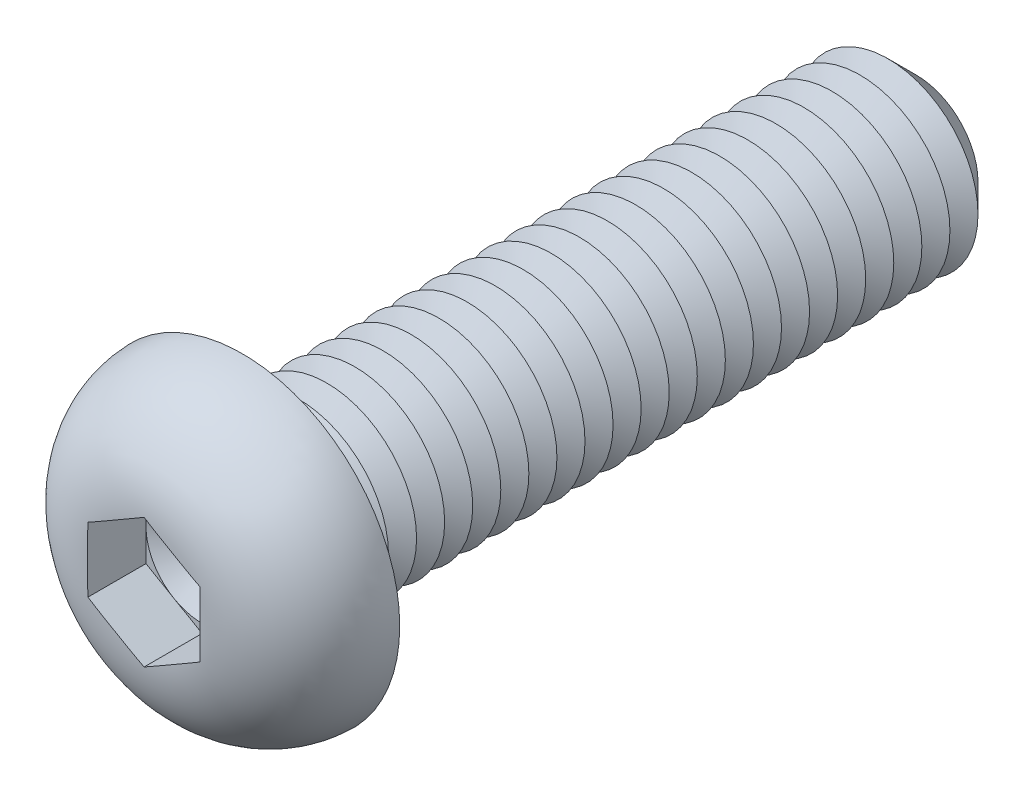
ISO-10303-21;
HEADER;
FILE_DESCRIPTION(('STEP AP214'),'2;1');
FILE_NAME('part.step','',(''),(''),'','','');
FILE_SCHEMA(('AUTOMOTIVE_DESIGN { 1 0 10303 214 1 1 1 1 }'));
ENDSEC;
DATA;
#1=APPLICATION_CONTEXT('core data for automotive mechanical design processes');
#2=APPLICATION_PROTOCOL_DEFINITION('international standard','automotive_design',2000,#1);
#3=PRODUCT_CONTEXT('',#1,'mechanical');
#4=PRODUCT('Part','Part','',(#3));
#5=PRODUCT_RELATED_PRODUCT_CATEGORY('part','',(#4));
#6=PRODUCT_DEFINITION_FORMATION('','',#4);
#7=PRODUCT_DEFINITION_CONTEXT('part definition',#1,'design');
#8=PRODUCT_DEFINITION('design','',#6,#7);
#9=PRODUCT_DEFINITION_SHAPE('','',#8);
#10=(LENGTH_UNIT() NAMED_UNIT(*) SI_UNIT(.MILLI.,.METRE.));
#11=(NAMED_UNIT(*) PLANE_ANGLE_UNIT() SI_UNIT($,.RADIAN.));
#12=(NAMED_UNIT(*) SI_UNIT($,.STERADIAN.) SOLID_ANGLE_UNIT());
#13=UNCERTAINTY_MEASURE_WITH_UNIT(LENGTH_MEASURE(1.E-05),#10,'distance_accuracy_value','');
#14=(GEOMETRIC_REPRESENTATION_CONTEXT(3) GLOBAL_UNCERTAINTY_ASSIGNED_CONTEXT((#13)) GLOBAL_UNIT_ASSIGNED_CONTEXT((#10,
#11,#12)) REPRESENTATION_CONTEXT('',''));
#15=CARTESIAN_POINT('',(0.,0.,0.));
#16=DIRECTION('',(0.,0.,1.));
#17=DIRECTION('',(1.,0.,0.));
#18=AXIS2_PLACEMENT_3D('',#15,#16,#17);
#19=CARTESIAN_POINT('',(0.,0.,1.8));
#20=DIRECTION('',(0.,0.,1.));
#21=DIRECTION('',(1.,0.,0.));
#22=AXIS2_PLACEMENT_3D('',#19,#20,#21);
#23=PLANE('',#22);
#24=CARTESIAN_POINT('',(0.,0.,1.8));
#25=DIRECTION('',(0.,0.,1.));
#26=DIRECTION('',(1.,0.,0.));
#27=AXIS2_PLACEMENT_3D('',#24,#25,#26);
#28=CIRCLE('',#27,2.5);
#29=CARTESIAN_POINT('',(2.5,0.,1.8));
#30=VERTEX_POINT('',#29);
#31=CARTESIAN_POINT('',(1.25,2.1650635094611,1.8));
#32=VERTEX_POINT('',#31);
#33=EDGE_CURVE('E153',#30,#32,#28,.T.);
#34=ORIENTED_EDGE('',*,*,#33,.F.);
#35=DIRECTION('',(0.,1.,0.));
#36=VECTOR('',#35,1.);
#37=CARTESIAN_POINT('',(2.5,-1.44337567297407,1.8));
#38=LINE('',#37,#36);
#39=CARTESIAN_POINT('',(2.5,1.44337567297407,1.8));
#40=VERTEX_POINT('',#39);
#41=EDGE_CURVE('E176',#30,#40,#38,.T.);
#42=ORIENTED_EDGE('',*,*,#41,.T.);
#43=DIRECTION('',(-0.866025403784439,0.5,0.));
#44=VECTOR('',#43,1.);
#45=CARTESIAN_POINT('',(2.5,1.44337567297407,1.8));
#46=LINE('',#45,#44);
#47=EDGE_CURVE('E172',#40,#32,#46,.T.);
#48=ORIENTED_EDGE('',*,*,#47,.T.);
#49=EDGE_LOOP('',(#34,#42,#48));
#50=FACE_BOUND('',#49,.T.);
#51=ADVANCED_FACE('F39',(#50),#23,.T.);
#52=CARTESIAN_POINT('',(0.,0.,1.8));
#53=DIRECTION('',(0.,0.,1.));
#54=DIRECTION('',(1.,0.,0.));
#55=AXIS2_PLACEMENT_3D('',#52,#53,#54);
#56=CIRCLE('',#55,2.5);
#57=CARTESIAN_POINT('',(-1.25,2.1650635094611,1.8));
#58=VERTEX_POINT('',#57);
#59=EDGE_CURVE('E11',#32,#58,#56,.T.);
#60=ORIENTED_EDGE('',*,*,#59,.F.);
#61=CARTESIAN_POINT('',(0.,2.88675134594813,1.8));
#62=VERTEX_POINT('',#61);
#63=EDGE_CURVE('E166',#32,#62,#46,.T.);
#64=ORIENTED_EDGE('',*,*,#63,.T.);
#65=DIRECTION('',(-0.866025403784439,-0.5,0.));
#66=VECTOR('',#65,1.);
#67=CARTESIAN_POINT('',(0.,2.88675134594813,1.8));
#68=LINE('',#67,#66);
#69=EDGE_CURVE('E167',#62,#58,#68,.T.);
#70=ORIENTED_EDGE('',*,*,#69,.T.);
#71=EDGE_LOOP('',(#60,#64,#70));
#72=FACE_BOUND('',#71,.T.);
#73=ADVANCED_FACE('F165',(#72),#23,.T.);
#74=CARTESIAN_POINT('',(-2.5,0.,1.8));
#75=VERTEX_POINT('',#74);
#76=EDGE_CURVE('E49',#58,#75,#56,.T.);
#77=ORIENTED_EDGE('',*,*,#76,.F.);
#78=CARTESIAN_POINT('',(-2.5,1.44337567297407,1.8));
#79=VERTEX_POINT('',#78);
#80=EDGE_CURVE('E179',#58,#79,#68,.T.);
#81=ORIENTED_EDGE('',*,*,#80,.T.);
#82=DIRECTION('',(0.,-1.,0.));
#83=VECTOR('',#82,1.);
#84=CARTESIAN_POINT('',(-2.5,1.44337567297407,1.8));
#85=LINE('',#84,#83);
#86=EDGE_CURVE('E190',#79,#75,#85,.T.);
#87=ORIENTED_EDGE('',*,*,#86,.T.);
#88=EDGE_LOOP('',(#77,#81,#87));
#89=FACE_BOUND('',#88,.T.);
#90=ADVANCED_FACE('F439',(#89),#23,.T.);
#91=CARTESIAN_POINT('',(-1.25,-2.1650635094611,1.8));
#92=VERTEX_POINT('',#91);
#93=EDGE_CURVE('E424',#75,#92,#56,.T.);
#94=ORIENTED_EDGE('',*,*,#93,.F.);
#95=CARTESIAN_POINT('',(-2.5,-1.44337567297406,1.8));
#96=VERTEX_POINT('',#95);
#97=EDGE_CURVE('E189',#75,#96,#85,.T.);
#98=ORIENTED_EDGE('',*,*,#97,.T.);
#99=DIRECTION('',(0.866025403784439,-0.5,0.));
#100=VECTOR('',#99,1.);
#101=CARTESIAN_POINT('',(-2.5,-1.44337567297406,1.8));
#102=LINE('',#101,#100);
#103=EDGE_CURVE('E195',#96,#92,#102,.T.);
#104=ORIENTED_EDGE('',*,*,#103,.T.);
#105=EDGE_LOOP('',(#94,#98,#104));
#106=FACE_BOUND('',#105,.T.);
#107=ADVANCED_FACE('F434',(#106),#23,.T.);
#108=CARTESIAN_POINT('',(1.25,-2.1650635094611,1.8));
#109=VERTEX_POINT('',#108);
#110=EDGE_CURVE('E56',#92,#109,#56,.T.);
#111=ORIENTED_EDGE('',*,*,#110,.F.);
#112=CARTESIAN_POINT('',(0.,-2.88675134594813,1.8));
#113=VERTEX_POINT('',#112);
#114=EDGE_CURVE('E194',#92,#113,#102,.T.);
#115=ORIENTED_EDGE('',*,*,#114,.T.);
#116=DIRECTION('',(0.866025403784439,0.5,0.));
#117=VECTOR('',#116,1.);
#118=CARTESIAN_POINT('',(0.,-2.88675134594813,1.8));
#119=LINE('',#118,#117);
#120=EDGE_CURVE('E200',#113,#109,#119,.T.);
#121=ORIENTED_EDGE('',*,*,#120,.T.);
#122=EDGE_LOOP('',(#111,#115,#121));
#123=FACE_BOUND('',#122,.T.);
#124=ADVANCED_FACE('F475',(#123),#23,.T.);
#125=CARTESIAN_POINT('',(0.,0.,-30.));
#126=DIRECTION('',(0.,0.,1.));
#127=DIRECTION('',(1.,0.,0.));
#128=AXIS2_PLACEMENT_3D('',#125,#126,#127);
#129=CYLINDRICAL_SURFACE('',#128,4.);
#130=CARTESIAN_POINT('',(0.,0.,-0.5));
#131=DIRECTION('',(0.,0.,1.));
#132=DIRECTION('',(1.,0.,0.));
#133=AXIS2_PLACEMENT_3D('',#130,#131,#132);
#134=CIRCLE('',#133,4.);
#135=CARTESIAN_POINT('',(4.,0.,-0.5));
#136=VERTEX_POINT('',#135);
#137=EDGE_CURVE('E410',#136,#136,#134,.F.);
#138=ORIENTED_EDGE('',*,*,#137,.T.);
#139=EDGE_LOOP('',(#138));
#140=FACE_BOUND('',#139,.T.);
#141=CARTESIAN_POINT('',(0.,0.,-1.25));
#142=DIRECTION('',(0.,0.,1.));
#143=DIRECTION('',(1.,0.,0.));
#144=AXIS2_PLACEMENT_3D('',#141,#142,#143);
#145=CIRCLE('',#144,4.00000000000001);
#146=CARTESIAN_POINT('',(4.00000000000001,0.,-1.25));
#147=VERTEX_POINT('',#146);
#148=EDGE_CURVE('E185',#147,#147,#145,.T.);
#149=ORIENTED_EDGE('',*,*,#148,.T.);
#150=EDGE_LOOP('',(#149));
#151=FACE_BOUND('',#150,.T.);
#152=ADVANCED_FACE('F470',(#140,#151),#129,.T.);
#153=CARTESIAN_POINT('',(0.,7.,0.));
#154=DIRECTION('',(0.,0.,1.));
#155=DIRECTION('',(1.,0.,0.));
#156=AXIS2_PLACEMENT_3D('',#153,#154,#155);
#157=PLANE('',#156);
#158=CARTESIAN_POINT('',(0.,0.,0.));
#159=DIRECTION('',(0.,0.,1.));
#160=DIRECTION('',(1.,0.,0.));
#161=AXIS2_PLACEMENT_3D('',#158,#159,#160);
#162=CIRCLE('',#161,4.5);
#163=CARTESIAN_POINT('',(4.5,0.,0.));
#164=VERTEX_POINT('',#163);
#165=EDGE_CURVE('E413',#164,#164,#162,.T.);
#166=ORIENTED_EDGE('',*,*,#165,.T.);
#167=EDGE_LOOP('',(#166));
#168=FACE_BOUND('',#167,.T.);
#169=CARTESIAN_POINT('',(0.,0.,0.));
#170=DIRECTION('',(0.,0.,1.));
#171=DIRECTION('',(1.,0.,0.));
#172=AXIS2_PLACEMENT_3D('',#169,#170,#171);
#173=CIRCLE('',#172,7.);
#174=CARTESIAN_POINT('',(7.,0.,0.));
#175=VERTEX_POINT('',#174);
#176=EDGE_CURVE('E210',#175,#175,#173,.T.);
#177=ORIENTED_EDGE('',*,*,#176,.F.);
#178=EDGE_LOOP('',(#177));
#179=FACE_BOUND('',#178,.T.);
#180=ADVANCED_FACE('F468',(#168,#179),#157,.F.);
#181=CARTESIAN_POINT('',(0.,0.,-0.1));
#182=DIRECTION('',(0.,0.,1.));
#183=DIRECTION('',(1.,0.,0.));
#184=AXIS2_PLACEMENT_3D('',#181,#182,#183);
#185=DEGENERATE_TOROIDAL_SURFACE('',#184,2.5011112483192,4.5,.T.);
#186=CARTESIAN_POINT('',(1.31456088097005,2.12778926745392,4.4));
#187=DIRECTION('',(-0.866025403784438,0.500000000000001,0.));
#188=VECTOR('',#187,1.);
#189=LINE('',#186,#188);
#190=CARTESIAN_POINT('',(1.31456088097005,2.12778926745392,4.4));
#191=VERTEX_POINT('',#190);
#192=CARTESIAN_POINT('',(1.18543911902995,2.20233775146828,4.4));
#193=VERTEX_POINT('',#192);
#194=EDGE_CURVE('E398',#191,#193,#189,.T.);
#195=ORIENTED_EDGE('',*,*,#194,.F.);
#196=CARTESIAN_POINT('',(-0.000200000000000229,2.88686681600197,4.38343536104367));
#197=CARTESIAN_POINT('',(0.103935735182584,2.82674402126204,4.38859262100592));
#198=CARTESIAN_POINT('',(0.208111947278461,2.76659785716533,4.39207570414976));
#199=CARTESIAN_POINT('',(0.416486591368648,2.64629270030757,4.39683754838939));
#200=CARTESIAN_POINT('',(0.520685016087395,2.58613371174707,4.39811670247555));
#201=CARTESIAN_POINT('',(0.729066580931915,2.46582455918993,4.3996156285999));
#202=CARTESIAN_POINT('',(0.833249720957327,2.40567439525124,4.39983556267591));
#203=CARTESIAN_POINT('',(1.04162190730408,2.2853706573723,4.4000276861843));
#204=CARTESIAN_POINT('',(1.14581095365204,2.2252170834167,4.39999986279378));
#205=CARTESIAN_POINT('',(1.35418904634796,2.10490993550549,4.39999986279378));
#206=CARTESIAN_POINT('',(1.45837809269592,2.04475636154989,4.4000276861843));
#207=CARTESIAN_POINT('',(1.66675027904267,1.92445262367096,4.39983556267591));
#208=CARTESIAN_POINT('',(1.77093341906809,1.86430245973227,4.3996156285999));
#209=CARTESIAN_POINT('',(1.97931498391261,1.74399330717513,4.39811670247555));
#210=CARTESIAN_POINT('',(2.08351340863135,1.68383431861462,4.39683754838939));
#211=CARTESIAN_POINT('',(2.29188805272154,1.56352916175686,4.39207570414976));
#212=CARTESIAN_POINT('',(2.39606426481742,1.50338299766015,4.38859262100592));
#213=CARTESIAN_POINT('',(2.5002,1.44326020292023,4.38343536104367));
#214=B_SPLINE_CURVE_WITH_KNOTS('',3,(#196,#197,#198,#199,#200,#201,#202,#203,#204,#205,#206,
#207,#208,#209,#210,#211,#212,#213),.UNSPECIFIED.,.F.,.F.,(4,2,2,2,2,2,2,2,4),(0.,
0.361022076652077,0.721979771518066,1.08288224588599,1.44380339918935,1.80472455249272,
2.16562702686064,2.52658472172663,2.88760679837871),.UNSPECIFIED.);
#215=CARTESIAN_POINT('',(2.5,1.44337567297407,4.38344529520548));
#216=VERTEX_POINT('',#215);
#217=EDGE_CURVE('E354',#191,#216,#214,.T.);
#218=ORIENTED_EDGE('',*,*,#217,.T.);
#219=CARTESIAN_POINT('',(2.5,0.,4.39999986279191));
#220=CARTESIAN_POINT('',(2.5,-0.104697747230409,4.39999811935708));
#221=CARTESIAN_POINT('',(2.5,-0.209395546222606,4.40001551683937));
#222=CARTESIAN_POINT('',(2.5,-0.418792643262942,4.39990807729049));
#223=CARTESIAN_POINT('',(2.5,-0.52349194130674,4.39978323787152));
#224=CARTESIAN_POINT('',(2.5,-0.732936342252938,4.39891238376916));
#225=CARTESIAN_POINT('',(2.5,-0.837681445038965,4.39816609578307));
#226=CARTESIAN_POINT('',(2.5,-1.04715282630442,4.39536239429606));
#227=CARTESIAN_POINT('',(2.5,-1.15187910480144,4.39330498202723));
#228=CARTESIAN_POINT('',(2.5,-1.46476484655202,4.38400647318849));
#229=CARTESIAN_POINT('',(2.5,-1.67286375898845,4.37365196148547));
#230=CARTESIAN_POINT('',(2.5,-2.08783281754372,4.33852954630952));
#231=CARTESIAN_POINT('',(2.5,-2.29470379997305,4.31377296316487));
#232=CARTESIAN_POINT('',(2.5,-2.64451002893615,4.25536510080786));
#233=CARTESIAN_POINT('',(2.5,-2.78823975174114,4.22651785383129));
#234=CARTESIAN_POINT('',(2.5,-3.073224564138,4.15827060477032));
#235=CARTESIAN_POINT('',(2.5,-3.21447933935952,4.11886927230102));
#236=CARTESIAN_POINT('',(2.5,-3.49353952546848,4.02870287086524));
#237=CARTESIAN_POINT('',(2.5,-3.6313402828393,3.97792330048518));
#238=CARTESIAN_POINT('',(2.5,-3.90204977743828,3.86463774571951));
#239=CARTESIAN_POINT('',(2.5,-4.0349587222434,3.8021322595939));
#240=CARTESIAN_POINT('',(2.5,-4.2956525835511,3.66474880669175));
#241=CARTESIAN_POINT('',(2.5,-4.42338586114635,3.58977252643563));
#242=CARTESIAN_POINT('',(2.5,-4.67118559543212,3.42803136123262));
#243=CARTESIAN_POINT('',(2.5,-4.79125159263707,3.3412657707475));
#244=CARTESIAN_POINT('',(2.5,-5.02233156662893,3.15645800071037));
#245=CARTESIAN_POINT('',(2.5,-5.13334771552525,3.05841854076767));
#246=CARTESIAN_POINT('',(2.5,-5.34506083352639,2.85177471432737));
#247=CARTESIAN_POINT('',(2.5,-5.44575933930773,2.74317192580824));
#248=CARTESIAN_POINT('',(2.5,-5.62335564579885,2.53102225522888));
#249=CARTESIAN_POINT('',(2.5,-5.70164721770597,2.42863868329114));
#250=CARTESIAN_POINT('',(2.5,-5.84882394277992,2.21725758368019));
#251=CARTESIAN_POINT('',(2.5,-5.91770588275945,2.10825781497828));
#252=CARTESIAN_POINT('',(2.5,-6.04532926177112,1.88460009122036));
#253=CARTESIAN_POINT('',(2.5,-6.1040794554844,1.76994713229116));
#254=CARTESIAN_POINT('',(2.5,-6.21098181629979,1.53574793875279));
#255=CARTESIAN_POINT('',(2.5,-6.25913021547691,1.41619998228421));
#256=CARTESIAN_POINT('',(2.5,-6.34173830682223,1.18065209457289));
#257=CARTESIAN_POINT('',(2.5,-6.37685491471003,1.06488207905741));
#258=CARTESIAN_POINT('',(2.5,-6.43703913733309,0.830714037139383));
#259=CARTESIAN_POINT('',(2.5,-6.46210319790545,0.712315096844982));
#260=CARTESIAN_POINT('',(2.5,-6.50194044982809,0.473848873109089));
#261=CARTESIAN_POINT('',(2.5,-6.51671856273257,0.353782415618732));
#262=CARTESIAN_POINT('',(2.5,-6.53588982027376,0.112808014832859));
#263=CARTESIAN_POINT('',(2.5,-6.54027911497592,-0.00810022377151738));
#264=CARTESIAN_POINT('',(2.5,-6.53779027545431,-0.365870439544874));
#265=CARTESIAN_POINT('',(2.5,-6.51607942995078,-0.602790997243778));
#266=CARTESIAN_POINT('',(2.5,-6.43310265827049,-1.06957107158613));
#267=CARTESIAN_POINT('',(2.5,-6.3718398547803,-1.29943114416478));
#268=CARTESIAN_POINT('',(2.5,-6.25195024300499,-1.63390601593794));
#269=CARTESIAN_POINT('',(2.5,-6.20730237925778,-1.74371189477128));
#270=CARTESIAN_POINT('',(2.5,-6.10902350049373,-1.95921136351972));
#271=CARTESIAN_POINT('',(2.5,-6.05539567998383,-2.06490639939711));
#272=CARTESIAN_POINT('',(2.5,-5.93955620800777,-2.27152527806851));
#273=CARTESIAN_POINT('',(2.5,-5.87734126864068,-2.37244727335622));
#274=CARTESIAN_POINT('',(2.5,-5.7448545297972,-2.56880727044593));
#275=CARTESIAN_POINT('',(2.5,-5.67458537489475,-2.6642470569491));
#276=CARTESIAN_POINT('',(2.5,-5.52523018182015,-2.85070592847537));
#277=CARTESIAN_POINT('',(2.5,-5.44601185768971,-2.94161901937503));
#278=CARTESIAN_POINT('',(2.5,-5.28044044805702,-3.11663859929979));
#279=CARTESIAN_POINT('',(2.5,-5.194089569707,-3.2007471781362));
#280=CARTESIAN_POINT('',(2.5,-5.01485870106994,-3.36178408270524));
#281=CARTESIAN_POINT('',(2.5,-4.92197538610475,-3.43870870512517));
#282=CARTESIAN_POINT('',(2.5,-4.73045535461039,-3.58495812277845));
#283=CARTESIAN_POINT('',(2.5,-4.6318202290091,-3.65428500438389));
#284=CARTESIAN_POINT('',(2.5,-4.4247626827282,-3.78818551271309));
#285=CARTESIAN_POINT('',(2.5,-4.31609824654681,-3.85238474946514));
#286=CARTESIAN_POINT('',(2.5,-4.0940582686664,-3.97208975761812));
#287=CARTESIAN_POINT('',(2.5,-3.98068153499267,-4.02759331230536));
#288=CARTESIAN_POINT('',(2.5,-3.75029026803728,-4.12981004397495));
#289=CARTESIAN_POINT('',(2.5,-3.63328275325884,-4.17653908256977));
#290=CARTESIAN_POINT('',(2.5,-3.39631992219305,-4.2614893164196));
#291=CARTESIAN_POINT('',(2.5,-3.27636651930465,-4.29971587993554));
#292=CARTESIAN_POINT('',(2.5,-3.00446622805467,-4.37644925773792));
#293=CARTESIAN_POINT('',(2.5,-2.85188931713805,-4.41272455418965));
#294=CARTESIAN_POINT('',(2.5,-2.54443794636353,-4.47385449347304));
#295=CARTESIAN_POINT('',(2.5,-2.3895624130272,-4.49870361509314));
#296=CARTESIAN_POINT('',(2.5,-2.07807451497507,-4.53870829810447));
#297=CARTESIAN_POINT('',(2.5,-1.92145805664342,-4.55383091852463));
#298=CARTESIAN_POINT('',(2.5,-1.60772330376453,-4.57647936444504));
#299=CARTESIAN_POINT('',(2.5,-1.45060502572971,-4.58400543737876));
#300=CARTESIAN_POINT('',(2.5,-1.13432460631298,-4.59416656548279));
#301=CARTESIAN_POINT('',(2.5,-0.975160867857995,-4.59674096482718));
#302=CARTESIAN_POINT('',(2.5,-0.656826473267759,-4.59957813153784));
#303=CARTESIAN_POINT('',(2.5,-0.497655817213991,-4.59984092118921));
#304=CARTESIAN_POINT('',(2.5,-0.179547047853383,-4.60005428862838));
#305=CARTESIAN_POINT('',(2.5,-0.02060893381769,-4.60000532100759));
#306=CARTESIAN_POINT('',(2.5,0.297265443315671,-4.59999304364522));
#307=CARTESIAN_POINT('',(2.5,0.456201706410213,-4.60002973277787));
#308=CARTESIAN_POINT('',(2.5,0.70967559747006,-4.59902611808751));
#309=CARTESIAN_POINT('',(2.5,0.804213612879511,-4.59841616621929));
#310=CARTESIAN_POINT('',(2.5,0.99327694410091,-4.59620676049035));
#311=CARTESIAN_POINT('',(2.5,1.08780225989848,-4.59460730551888));
#312=CARTESIAN_POINT('',(2.5,1.37137837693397,-4.58746770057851));
#313=CARTESIAN_POINT('',(2.5,1.56039301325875,-4.57958602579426));
#314=CARTESIAN_POINT('',(2.5,1.93609462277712,-4.55305686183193));
#315=CARTESIAN_POINT('',(2.5,2.12278756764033,-4.53450331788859));
#316=CARTESIAN_POINT('',(2.5,2.49421016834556,-4.48296248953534));
#317=CARTESIAN_POINT('',(2.5,2.67894050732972,-4.44998040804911));
#318=CARTESIAN_POINT('',(2.5,2.99962701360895,-4.37718406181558));
#319=CARTESIAN_POINT('',(2.5,3.13641465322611,-4.34103978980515));
#320=CARTESIAN_POINT('',(2.5,3.40682838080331,-4.25834226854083));
#321=CARTESIAN_POINT('',(2.5,3.54045461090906,-4.21178948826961));
#322=CARTESIAN_POINT('',(2.5,3.80387940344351,-4.1076796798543));
#323=CARTESIAN_POINT('',(2.5,3.93366385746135,-4.05008679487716));
#324=CARTESIAN_POINT('',(2.5,4.18776789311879,-3.92385886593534));
#325=CARTESIAN_POINT('',(2.5,4.31208736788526,-3.85522360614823));
#326=CARTESIAN_POINT('',(2.5,4.55475418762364,-3.70660227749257));
#327=CARTESIAN_POINT('',(2.5,4.67306276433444,-3.62655275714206));
#328=CARTESIAN_POINT('',(2.5,4.90171316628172,-3.45576294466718));
#329=CARTESIAN_POINT('',(2.5,5.01205476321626,-3.36502234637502));
#330=CARTESIAN_POINT('',(2.5,5.22347091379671,-3.17353376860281));
#331=CARTESIAN_POINT('',(2.5,5.32455555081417,-3.07279693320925));
#332=CARTESIAN_POINT('',(2.5,5.51647993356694,-2.86200023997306));
#333=CARTESIAN_POINT('',(2.5,5.6073208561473,-2.75194145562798));
#334=CARTESIAN_POINT('',(2.5,5.76832451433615,-2.53607083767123));
#335=CARTESIAN_POINT('',(2.5,5.83966300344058,-2.4311337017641));
#336=CARTESIAN_POINT('',(2.5,5.97282702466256,-2.2153291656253));
#337=CARTESIAN_POINT('',(2.5,6.03464926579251,-2.10445973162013));
#338=CARTESIAN_POINT('',(2.5,6.14815657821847,-1.87771731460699));
#339=CARTESIAN_POINT('',(2.5,6.19984675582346,-1.76184688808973));
#340=CARTESIAN_POINT('',(2.5,6.29267395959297,-1.52590109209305));
#341=CARTESIAN_POINT('',(2.5,6.33380720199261,-1.40582423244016));
#342=CARTESIAN_POINT('',(2.5,6.40328888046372,-1.16869740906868));
#343=CARTESIAN_POINT('',(2.5,6.43218419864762,-1.05180738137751));
#344=CARTESIAN_POINT('',(2.5,6.47988151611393,-0.815941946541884));
#345=CARTESIAN_POINT('',(2.5,6.49867991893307,-0.696965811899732));
#346=CARTESIAN_POINT('',(2.5,6.52599950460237,-0.457898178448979));
#347=CARTESIAN_POINT('',(2.5,6.53452634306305,-0.337807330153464));
#348=CARTESIAN_POINT('',(2.5,6.54126106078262,-0.0973214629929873));
#349=CARTESIAN_POINT('',(2.5,6.5394651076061,0.023073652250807));
#350=CARTESIAN_POINT('',(2.5,6.51879545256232,0.379398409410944));
#351=CARTESIAN_POINT('',(2.5,6.48510560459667,0.614630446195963));
#352=CARTESIAN_POINT('',(2.5,6.37872360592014,1.07608887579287));
#353=CARTESIAN_POINT('',(2.5,6.30603128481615,1.3023152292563));
#354=CARTESIAN_POINT('',(2.5,6.16957161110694,1.63028303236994));
#355=CARTESIAN_POINT('',(2.5,6.11941470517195,1.7378698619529));
#356=CARTESIAN_POINT('',(2.5,6.01034124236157,1.94849153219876));
#357=CARTESIAN_POINT('',(2.5,5.9514277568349,2.05152795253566));
#358=CARTESIAN_POINT('',(2.5,5.82528890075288,2.25240256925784));
#359=CARTESIAN_POINT('',(2.5,5.75806159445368,2.35023954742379));
#360=CARTESIAN_POINT('',(2.5,5.61585543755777,2.54005689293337));
#361=CARTESIAN_POINT('',(2.5,5.54087908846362,2.63203913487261));
#362=CARTESIAN_POINT('',(2.5,5.38212190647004,2.81146438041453));
#363=CARTESIAN_POINT('',(2.5,5.29819182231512,2.89877528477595));
#364=CARTESIAN_POINT('',(2.5,5.12353712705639,3.06625194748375));
#365=CARTESIAN_POINT('',(2.5,5.03281455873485,3.14641983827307));
#366=CARTESIAN_POINT('',(2.5,4.84518171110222,3.29930665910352));
#367=CARTESIAN_POINT('',(2.5,4.74826657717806,3.37201962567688));
#368=CARTESIAN_POINT('',(2.5,4.54907485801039,3.50961479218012));
#369=CARTESIAN_POINT('',(2.5,4.44679969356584,3.57449905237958));
#370=CARTESIAN_POINT('',(2.5,4.23202545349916,3.69953578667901));
#371=CARTESIAN_POINT('',(2.5,4.11927203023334,3.75925114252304));
#372=CARTESIAN_POINT('',(2.5,3.88947986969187,3.86977617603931));
#373=CARTESIAN_POINT('',(2.5,3.77244067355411,3.92058489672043));
#374=CARTESIAN_POINT('',(2.5,3.5351804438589,4.0133148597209));
#375=CARTESIAN_POINT('',(2.5,3.41496637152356,4.0552539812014));
#376=CARTESIAN_POINT('',(2.5,3.17195278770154,4.13067246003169));
#377=CARTESIAN_POINT('',(2.5,3.04915378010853,4.16415344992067));
#378=CARTESIAN_POINT('',(2.5,2.80683027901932,4.22194717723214));
#379=CARTESIAN_POINT('',(2.5,2.68738216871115,4.2465834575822));
#380=CARTESIAN_POINT('',(2.5,2.44729214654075,4.28920746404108));
#381=CARTESIAN_POINT('',(2.5,2.32664997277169,4.30719369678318));
#382=CARTESIAN_POINT('',(2.5,2.08450864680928,4.33736171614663));
#383=CARTESIAN_POINT('',(2.5,1.9630086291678,4.3495363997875));
#384=CARTESIAN_POINT('',(2.5,1.71961501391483,4.36908103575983));
#385=CARTESIAN_POINT('',(2.5,1.59772134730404,4.37645009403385));
#386=CARTESIAN_POINT('',(2.5,1.35283283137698,4.38761579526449));
#387=CARTESIAN_POINT('',(2.5,1.22983679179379,4.39138420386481));
#388=CARTESIAN_POINT('',(2.5,0.983808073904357,4.3965493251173));
#389=CARTESIAN_POINT('',(2.5,0.860775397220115,4.3979461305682));
#390=CARTESIAN_POINT('',(2.5,0.614783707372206,4.39958107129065));
#391=CARTESIAN_POINT('',(2.5,0.491824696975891,4.3998199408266));
#392=CARTESIAN_POINT('',(2.5,0.245910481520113,4.40003035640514));
#393=CARTESIAN_POINT('',(2.5,0.122955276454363,4.4000019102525));
#394=CARTESIAN_POINT('',(2.5,0.,4.39999986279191));
#395=B_SPLINE_CURVE_WITH_KNOTS('',3,(#219,#220,#221,#222,#223,#224,#225,#226,#227,#228,#229,
#230,#231,#232,#233,#234,#235,#236,#237,#238,#239,#240,#241,#242,#243,#244,#245,#246,#247,#248,
#249,#250,#251,#252,#253,#254,#255,#256,#257,#258,#259,#260,#261,#262,#263,#264,#265,#266,#267,
#268,#269,#270,#271,#272,#273,#274,#275,#276,#277,#278,#279,#280,#281,#282,#283,#284,#285,#286,
#287,#288,#289,#290,#291,#292,#293,#294,#295,#296,#297,#298,#299,#300,#301,#302,#303,#304,#305,
#306,#307,#308,#309,#310,#311,#312,#313,#314,#315,#316,#317,#318,#319,#320,#321,#322,#323,#324,
#325,#326,#327,#328,#329,#330,#331,#332,#333,#334,#335,#336,#337,#338,#339,#340,#341,#342,#343,
#344,#345,#346,#347,#348,#349,#350,#351,#352,#353,#354,#355,#356,#357,#358,#359,#360,#361,#362,
#363,#364,#365,#366,#367,#368,#369,#370,#371,#372,#373,#374,#375,#376,#377,#378,#379,#380,#381,
#382,#383,#384,#385,#386,#387,#388,#389,#390,#391,#392,#393,#394),.UNSPECIFIED.,.T.,.F.,(4,2,2,
2,2,2,2,2,2,2,2,2,2,2,2,2,2,2,2,2,2,2,2,2,2,2,2,2,2,2,2,2,2,2,2,2,2,2,2,2,2,2,2,2,2,2,2,2,2,2,2,
2,2,2,2,2,2,2,2,2,2,2,2,2,2,2,2,2,2,2,2,2,2,2,2,2,2,2,2,2,2,2,2,2,2,2,2,4),(0.,
0.314093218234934,0.62819170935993,0.942428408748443,1.25666481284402,1.88144147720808,
2.50572771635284,2.94516878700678,3.38466527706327,3.82472511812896,4.26476626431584,
4.70845695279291,5.15217420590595,5.59578464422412,6.03932891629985,6.42549664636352,
6.81179591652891,7.19775970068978,7.58386043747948,7.94635637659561,8.30898036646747,
8.67143073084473,9.03401539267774,9.74414367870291,10.4542159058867,10.8094792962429,
11.1646165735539,11.5198902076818,11.8750475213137,12.2363927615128,12.597626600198,
12.9590456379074,13.3203651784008,13.698597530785,14.0769261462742,14.4545641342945,
14.8319630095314,15.3019396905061,15.7721432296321,16.2439309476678,16.715703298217,
17.1932187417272,17.6707295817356,18.1475442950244,18.6243527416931,18.9079682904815,
19.1915841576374,19.7589248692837,20.3213460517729,20.8835645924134,21.3076400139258,
21.731696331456,22.1571540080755,22.5826200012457,23.0105507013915,23.4384936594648,
23.8659647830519,24.2933867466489,24.6735755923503,25.0538956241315,25.4340234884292,
25.8142874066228,26.1750761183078,26.5359932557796,26.8967115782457,27.2575638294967,
27.9668653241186,28.6761699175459,29.0319382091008,29.3875820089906,29.7433087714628,
30.0989210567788,30.4618400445,30.8246503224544,31.1877485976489,31.5507511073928,
31.9331198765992,32.3155297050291,32.6971611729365,33.0787189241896,33.4443988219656,
33.8101607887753,34.1763686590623,34.54264464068,34.9117697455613,35.2808804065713,
35.6497569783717,36.0186227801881),.UNSPECIFIED.);
#396=CARTESIAN_POINT('',(2.5,0.0745484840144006,4.4));
#397=VERTEX_POINT('',#396);
#398=EDGE_CURVE('E344',#216,#397,#395,.T.);
#399=ORIENTED_EDGE('',*,*,#398,.T.);
#400=CARTESIAN_POINT('',(2.5,-0.0745484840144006,4.4));
#401=DIRECTION('',(0.,1.,0.));
#402=VECTOR('',#401,1.);
#403=LINE('',#400,#402);
#404=CARTESIAN_POINT('',(2.5,-0.0745484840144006,4.4));
#405=VERTEX_POINT('',#404);
#406=EDGE_CURVE('E174',#405,#397,#403,.T.);
#407=ORIENTED_EDGE('',*,*,#406,.F.);
#408=CARTESIAN_POINT('',(2.5,-1.44337567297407,4.38344529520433));
#409=VERTEX_POINT('',#408);
#410=EDGE_CURVE('E355',#405,#409,#395,.T.);
#411=ORIENTED_EDGE('',*,*,#410,.T.);
#412=CARTESIAN_POINT('',(2.5002,-1.44326020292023,4.38343536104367));
#413=CARTESIAN_POINT('',(2.39606426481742,-1.50338299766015,4.38859262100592));
#414=CARTESIAN_POINT('',(2.29188805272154,-1.56352916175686,4.39207570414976));
#415=CARTESIAN_POINT('',(2.08351340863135,-1.68383431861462,4.39683754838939));
#416=CARTESIAN_POINT('',(1.9793149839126,-1.74399330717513,4.39811670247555));
#417=CARTESIAN_POINT('',(1.77093341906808,-1.86430245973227,4.3996156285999));
#418=CARTESIAN_POINT('',(1.66675027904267,-1.92445262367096,4.39983556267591));
#419=CARTESIAN_POINT('',(1.45837809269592,-2.04475636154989,4.4000276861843));
#420=CARTESIAN_POINT('',(1.35418904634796,-2.10490993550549,4.39999986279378));
#421=CARTESIAN_POINT('',(1.14581095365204,-2.2252170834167,4.39999986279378));
#422=CARTESIAN_POINT('',(1.04162190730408,-2.2853706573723,4.4000276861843));
#423=CARTESIAN_POINT('',(0.833249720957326,-2.40567439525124,4.39983556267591));
#424=CARTESIAN_POINT('',(0.729066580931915,-2.46582455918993,4.3996156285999));
#425=CARTESIAN_POINT('',(0.520685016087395,-2.58613371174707,4.39811670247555));
#426=CARTESIAN_POINT('',(0.416486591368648,-2.64629270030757,4.39683754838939));
#427=CARTESIAN_POINT('',(0.208111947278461,-2.76659785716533,4.39207570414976));
#428=CARTESIAN_POINT('',(0.103935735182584,-2.82674402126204,4.38859262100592));
#429=CARTESIAN_POINT('',(-0.000200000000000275,-2.88686681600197,4.38343536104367));
#430=B_SPLINE_CURVE_WITH_KNOTS('',3,(#412,#413,#414,#415,#416,#417,#418,#419,#420,#421,#422,
#423,#424,#425,#426,#427,#428,#429),.UNSPECIFIED.,.F.,.F.,(4,2,2,2,2,2,2,2,4),(0.,
0.361022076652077,0.721979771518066,1.08288224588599,1.44380339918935,1.80472455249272,
2.16562702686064,2.52658472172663,2.88760679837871),.UNSPECIFIED.);
#431=CARTESIAN_POINT('',(1.31456088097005,-2.12778926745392,4.4));
#432=VERTEX_POINT('',#431);
#433=EDGE_CURVE('E331',#409,#432,#430,.T.);
#434=ORIENTED_EDGE('',*,*,#433,.T.);
#435=CARTESIAN_POINT('',(1.18543911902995,-2.20233775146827,4.4));
#436=DIRECTION('',(0.866025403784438,0.500000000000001,0.));
#437=VECTOR('',#436,1.);
#438=LINE('',#435,#437);
#439=CARTESIAN_POINT('',(1.18543911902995,-2.20233775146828,4.4));
#440=VERTEX_POINT('',#439);
#441=EDGE_CURVE('E340',#440,#432,#438,.T.);
#442=ORIENTED_EDGE('',*,*,#441,.F.);
#443=CARTESIAN_POINT('',(0.,-2.88675134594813,4.38344529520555));
#444=VERTEX_POINT('',#443);
#445=EDGE_CURVE('E294',#440,#444,#430,.T.);
#446=ORIENTED_EDGE('',*,*,#445,.T.);
#447=CARTESIAN_POINT('',(0.00019999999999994,-2.88686681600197,4.38343536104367));
#448=CARTESIAN_POINT('',(-0.103935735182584,-2.82674402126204,4.38859262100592));
#449=CARTESIAN_POINT('',(-0.208111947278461,-2.76659785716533,4.39207570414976));
#450=CARTESIAN_POINT('',(-0.416486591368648,-2.64629270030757,4.39683754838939));
#451=CARTESIAN_POINT('',(-0.520685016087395,-2.58613371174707,4.39811670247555));
#452=CARTESIAN_POINT('',(-0.729066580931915,-2.46582455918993,4.3996156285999));
#453=CARTESIAN_POINT('',(-0.833249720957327,-2.40567439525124,4.39983556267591));
#454=CARTESIAN_POINT('',(-1.04162190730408,-2.2853706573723,4.4000276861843));
#455=CARTESIAN_POINT('',(-1.14581095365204,-2.2252170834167,4.39999986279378));
#456=CARTESIAN_POINT('',(-1.35418904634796,-2.10490993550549,4.39999986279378));
#457=CARTESIAN_POINT('',(-1.45837809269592,-2.04475636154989,4.4000276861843));
#458=CARTESIAN_POINT('',(-1.66675027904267,-1.92445262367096,4.39983556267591));
#459=CARTESIAN_POINT('',(-1.77093341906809,-1.86430245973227,4.3996156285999));
#460=CARTESIAN_POINT('',(-1.97931498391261,-1.74399330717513,4.39811670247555));
#461=CARTESIAN_POINT('',(-2.08351340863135,-1.68383431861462,4.39683754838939));
#462=CARTESIAN_POINT('',(-2.29188805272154,-1.56352916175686,4.39207570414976));
#463=CARTESIAN_POINT('',(-2.39606426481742,-1.50338299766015,4.38859262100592));
#464=CARTESIAN_POINT('',(-2.5002,-1.44326020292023,4.38343536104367));
#465=B_SPLINE_CURVE_WITH_KNOTS('',3,(#447,#448,#449,#450,#451,#452,#453,#454,#455,#456,#457,
#458,#459,#460,#461,#462,#463,#464),.UNSPECIFIED.,.F.,.F.,(4,2,2,2,2,2,2,2,4),(0.,
0.361022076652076,0.721979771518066,1.08288224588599,1.44380339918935,1.80472455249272,
2.16562702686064,2.52658472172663,2.88760679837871),.UNSPECIFIED.);
#466=CARTESIAN_POINT('',(-1.18543911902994,-2.20233775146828,4.4));
#467=VERTEX_POINT('',#466);
#468=EDGE_CURVE('E284',#444,#467,#465,.T.);
#469=ORIENTED_EDGE('',*,*,#468,.T.);
#470=CARTESIAN_POINT('',(-1.31456088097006,-2.12778926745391,4.4));
#471=DIRECTION('',(0.86602540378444,-0.499999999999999,0.));
#472=VECTOR('',#471,1.);
#473=LINE('',#470,#472);
#474=CARTESIAN_POINT('',(-1.31456088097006,-2.12778926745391,4.4));
#475=VERTEX_POINT('',#474);
#476=EDGE_CURVE('E618',#475,#467,#473,.T.);
#477=ORIENTED_EDGE('',*,*,#476,.F.);
#478=CARTESIAN_POINT('',(-2.5,-1.44337567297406,4.38344529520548));
#479=VERTEX_POINT('',#478);
#480=EDGE_CURVE('E295',#475,#479,#465,.T.);
#481=ORIENTED_EDGE('',*,*,#480,.T.);
#482=CARTESIAN_POINT('',(-2.5,0.,4.39999986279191));
#483=CARTESIAN_POINT('',(-2.5,0.104697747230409,4.39999811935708));
#484=CARTESIAN_POINT('',(-2.5,0.209395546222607,4.40001551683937));
#485=CARTESIAN_POINT('',(-2.5,0.418792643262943,4.39990807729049));
#486=CARTESIAN_POINT('',(-2.5,0.523491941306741,4.39978323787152));
#487=CARTESIAN_POINT('',(-2.5,0.732936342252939,4.39891238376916));
#488=CARTESIAN_POINT('',(-2.5,0.837681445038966,4.39816609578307));
#489=CARTESIAN_POINT('',(-2.5,1.04715282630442,4.39536239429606));
#490=CARTESIAN_POINT('',(-2.5,1.15187910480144,4.39330498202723));
#491=CARTESIAN_POINT('',(-2.5,1.46476484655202,4.38400647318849));
#492=CARTESIAN_POINT('',(-2.5,1.67286375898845,4.37365196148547));
#493=CARTESIAN_POINT('',(-2.5,2.08783281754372,4.33852954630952));
#494=CARTESIAN_POINT('',(-2.5,2.29470379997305,4.31377296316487));
#495=CARTESIAN_POINT('',(-2.5,2.64451002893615,4.25536510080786));
#496=CARTESIAN_POINT('',(-2.5,2.78823975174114,4.22651785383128));
#497=CARTESIAN_POINT('',(-2.5,3.073224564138,4.15827060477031));
#498=CARTESIAN_POINT('',(-2.5,3.21447933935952,4.11886927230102));
#499=CARTESIAN_POINT('',(-2.5,3.49353952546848,4.02870287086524));
#500=CARTESIAN_POINT('',(-2.5,3.6313402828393,3.97792330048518));
#501=CARTESIAN_POINT('',(-2.5,3.90204977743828,3.8646377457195));
#502=CARTESIAN_POINT('',(-2.5,4.0349587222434,3.8021322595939));
#503=CARTESIAN_POINT('',(-2.5,4.2956525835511,3.66474880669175));
#504=CARTESIAN_POINT('',(-2.5,4.42338586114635,3.58977252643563));
#505=CARTESIAN_POINT('',(-2.5,4.67118559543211,3.42803136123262));
#506=CARTESIAN_POINT('',(-2.5,4.79125159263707,3.3412657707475));
#507=CARTESIAN_POINT('',(-2.5,5.02233156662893,3.15645800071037));
#508=CARTESIAN_POINT('',(-2.5,5.13334771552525,3.05841854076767));
#509=CARTESIAN_POINT('',(-2.5,5.34506083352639,2.85177471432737));
#510=CARTESIAN_POINT('',(-2.5,5.44575933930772,2.74317192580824));
#511=CARTESIAN_POINT('',(-2.5,5.62335564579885,2.53102225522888));
#512=CARTESIAN_POINT('',(-2.5,5.70164721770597,2.42863868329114));
#513=CARTESIAN_POINT('',(-2.5,5.84882394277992,2.21725758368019));
#514=CARTESIAN_POINT('',(-2.5,5.91770588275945,2.10825781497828));
#515=CARTESIAN_POINT('',(-2.5,6.04532926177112,1.88460009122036));
#516=CARTESIAN_POINT('',(-2.5,6.1040794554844,1.76994713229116));
#517=CARTESIAN_POINT('',(-2.5,6.21098181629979,1.53574793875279));
#518=CARTESIAN_POINT('',(-2.5,6.25913021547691,1.41619998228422));
#519=CARTESIAN_POINT('',(-2.5,6.34173830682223,1.18065209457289));
#520=CARTESIAN_POINT('',(-2.5,6.37685491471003,1.06488207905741));
#521=CARTESIAN_POINT('',(-2.5,6.43703913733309,0.830714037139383));
#522=CARTESIAN_POINT('',(-2.5,6.46210319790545,0.712315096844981));
#523=CARTESIAN_POINT('',(-2.5,6.50194044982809,0.473848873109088));
#524=CARTESIAN_POINT('',(-2.5,6.51671856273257,0.35378241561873));
#525=CARTESIAN_POINT('',(-2.5,6.53588982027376,0.112808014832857));
#526=CARTESIAN_POINT('',(-2.5,6.54027911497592,-0.00810022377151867));
#527=CARTESIAN_POINT('',(-2.5,6.53779027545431,-0.365870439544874));
#528=CARTESIAN_POINT('',(-2.5,6.51607942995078,-0.602790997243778));
#529=CARTESIAN_POINT('',(-2.5,6.43310265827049,-1.06957107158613));
#530=CARTESIAN_POINT('',(-2.5,6.3718398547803,-1.29943114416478));
#531=CARTESIAN_POINT('',(-2.5,6.25195024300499,-1.63390601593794));
#532=CARTESIAN_POINT('',(-2.5,6.20730237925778,-1.74371189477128));
#533=CARTESIAN_POINT('',(-2.5,6.10902350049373,-1.95921136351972));
#534=CARTESIAN_POINT('',(-2.5,6.05539567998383,-2.06490639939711));
#535=CARTESIAN_POINT('',(-2.5,5.93955620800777,-2.27152527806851));
#536=CARTESIAN_POINT('',(-2.5,5.87734126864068,-2.37244727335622));
#537=CARTESIAN_POINT('',(-2.5,5.7448545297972,-2.56880727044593));
#538=CARTESIAN_POINT('',(-2.5,5.67458537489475,-2.6642470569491));
#539=CARTESIAN_POINT('',(-2.5,5.52523018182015,-2.85070592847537));
#540=CARTESIAN_POINT('',(-2.5,5.44601185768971,-2.94161901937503));
#541=CARTESIAN_POINT('',(-2.5,5.28044044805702,-3.11663859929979));
#542=CARTESIAN_POINT('',(-2.5,5.194089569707,-3.2007471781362));
#543=CARTESIAN_POINT('',(-2.5,5.01485870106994,-3.36178408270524));
#544=CARTESIAN_POINT('',(-2.5,4.92197538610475,-3.43870870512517));
#545=CARTESIAN_POINT('',(-2.5,4.73045535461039,-3.58495812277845));
#546=CARTESIAN_POINT('',(-2.5,4.6318202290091,-3.65428500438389));
#547=CARTESIAN_POINT('',(-2.5,4.4247626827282,-3.78818551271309));
#548=CARTESIAN_POINT('',(-2.5,4.31609824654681,-3.85238474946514));
#549=CARTESIAN_POINT('',(-2.5,4.0940582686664,-3.97208975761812));
#550=CARTESIAN_POINT('',(-2.5,3.98068153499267,-4.02759331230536));
#551=CARTESIAN_POINT('',(-2.5,3.75029026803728,-4.12981004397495));
#552=CARTESIAN_POINT('',(-2.5,3.63328275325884,-4.17653908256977));
#553=CARTESIAN_POINT('',(-2.5,3.39631992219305,-4.2614893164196));
#554=CARTESIAN_POINT('',(-2.5,3.27636651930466,-4.29971587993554));
#555=CARTESIAN_POINT('',(-2.5,3.00446622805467,-4.37644925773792));
#556=CARTESIAN_POINT('',(-2.5,2.85188931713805,-4.41272455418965));
#557=CARTESIAN_POINT('',(-2.5,2.54443794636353,-4.47385449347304));
#558=CARTESIAN_POINT('',(-2.5,2.3895624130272,-4.49870361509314));
#559=CARTESIAN_POINT('',(-2.5,2.07807451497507,-4.53870829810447));
#560=CARTESIAN_POINT('',(-2.5,1.92145805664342,-4.55383091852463));
#561=CARTESIAN_POINT('',(-2.5,1.60772330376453,-4.57647936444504));
#562=CARTESIAN_POINT('',(-2.5,1.45060502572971,-4.58400543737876));
#563=CARTESIAN_POINT('',(-2.5,1.13432460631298,-4.59416656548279));
#564=CARTESIAN_POINT('',(-2.5,0.975160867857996,-4.59674096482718));
#565=CARTESIAN_POINT('',(-2.5,0.65682647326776,-4.59957813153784));
#566=CARTESIAN_POINT('',(-2.5,0.497655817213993,-4.59984092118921));
#567=CARTESIAN_POINT('',(-2.5,0.179547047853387,-4.60005428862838));
#568=CARTESIAN_POINT('',(-2.5,0.0206089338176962,-4.60000532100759));
#569=CARTESIAN_POINT('',(-2.5,-0.297265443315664,-4.59999304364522));
#570=CARTESIAN_POINT('',(-2.5,-0.456201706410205,-4.60002973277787));
#571=CARTESIAN_POINT('',(-2.5,-0.709675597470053,-4.59902611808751));
#572=CARTESIAN_POINT('',(-2.5,-0.804213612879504,-4.59841616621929));
#573=CARTESIAN_POINT('',(-2.5,-0.993276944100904,-4.59620676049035));
#574=CARTESIAN_POINT('',(-2.5,-1.08780225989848,-4.59460730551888));
#575=CARTESIAN_POINT('',(-2.5,-1.37137837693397,-4.58746770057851));
#576=CARTESIAN_POINT('',(-2.5,-1.56039301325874,-4.57958602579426));
#577=CARTESIAN_POINT('',(-2.5,-1.93609462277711,-4.55305686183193));
#578=CARTESIAN_POINT('',(-2.5,-2.12278756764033,-4.53450331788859));
#579=CARTESIAN_POINT('',(-2.5,-2.49421016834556,-4.48296248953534));
#580=CARTESIAN_POINT('',(-2.5,-2.67894050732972,-4.44998040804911));
#581=CARTESIAN_POINT('',(-2.5,-2.99962701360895,-4.37718406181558));
#582=CARTESIAN_POINT('',(-2.5,-3.13641465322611,-4.34103978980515));
#583=CARTESIAN_POINT('',(-2.5,-3.40682838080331,-4.25834226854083));
#584=CARTESIAN_POINT('',(-2.5,-3.54045461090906,-4.21178948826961));
#585=CARTESIAN_POINT('',(-2.5,-3.8038794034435,-4.1076796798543));
#586=CARTESIAN_POINT('',(-2.5,-3.93366385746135,-4.05008679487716));
#587=CARTESIAN_POINT('',(-2.5,-4.18776789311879,-3.92385886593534));
#588=CARTESIAN_POINT('',(-2.5,-4.31208736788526,-3.85522360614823));
#589=CARTESIAN_POINT('',(-2.5,-4.55475418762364,-3.70660227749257));
#590=CARTESIAN_POINT('',(-2.5,-4.67306276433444,-3.62655275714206));
#591=CARTESIAN_POINT('',(-2.5,-4.90171316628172,-3.45576294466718));
#592=CARTESIAN_POINT('',(-2.5,-5.01205476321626,-3.36502234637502));
#593=CARTESIAN_POINT('',(-2.5,-5.2234709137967,-3.17353376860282));
#594=CARTESIAN_POINT('',(-2.5,-5.32455555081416,-3.07279693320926));
#595=CARTESIAN_POINT('',(-2.5,-5.51647993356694,-2.86200023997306));
#596=CARTESIAN_POINT('',(-2.5,-5.6073208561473,-2.75194145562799));
#597=CARTESIAN_POINT('',(-2.5,-5.76832451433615,-2.53607083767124));
#598=CARTESIAN_POINT('',(-2.5,-5.83966300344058,-2.4311337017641));
#599=CARTESIAN_POINT('',(-2.5,-5.97282702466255,-2.2153291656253));
#600=CARTESIAN_POINT('',(-2.5,-6.03464926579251,-2.10445973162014));
#601=CARTESIAN_POINT('',(-2.5,-6.14815657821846,-1.877717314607));
#602=CARTESIAN_POINT('',(-2.5,-6.19984675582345,-1.76184688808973));
#603=CARTESIAN_POINT('',(-2.5,-6.29267395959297,-1.52590109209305));
#604=CARTESIAN_POINT('',(-2.5,-6.33380720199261,-1.40582423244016));
#605=CARTESIAN_POINT('',(-2.5,-6.40328888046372,-1.16869740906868));
#606=CARTESIAN_POINT('',(-2.5,-6.43218419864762,-1.05180738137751));
#607=CARTESIAN_POINT('',(-2.5,-6.47988151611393,-0.815941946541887));
#608=CARTESIAN_POINT('',(-2.5,-6.49867991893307,-0.696965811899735));
#609=CARTESIAN_POINT('',(-2.5,-6.52599950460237,-0.457898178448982));
#610=CARTESIAN_POINT('',(-2.5,-6.53452634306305,-0.337807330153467));
#611=CARTESIAN_POINT('',(-2.5,-6.54126106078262,-0.09732146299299));
#612=CARTESIAN_POINT('',(-2.5,-6.5394651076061,0.0230736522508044));
#613=CARTESIAN_POINT('',(-2.5,-6.51879545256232,0.379398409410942));
#614=CARTESIAN_POINT('',(-2.5,-6.48510560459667,0.614630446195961));
#615=CARTESIAN_POINT('',(-2.5,-6.37872360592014,1.07608887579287));
#616=CARTESIAN_POINT('',(-2.5,-6.30603128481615,1.3023152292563));
#617=CARTESIAN_POINT('',(-2.5,-6.16957161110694,1.63028303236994));
#618=CARTESIAN_POINT('',(-2.5,-6.11941470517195,1.7378698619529));
#619=CARTESIAN_POINT('',(-2.5,-6.01034124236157,1.94849153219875));
#620=CARTESIAN_POINT('',(-2.5,-5.9514277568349,2.05152795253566));
#621=CARTESIAN_POINT('',(-2.5,-5.82528890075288,2.25240256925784));
#622=CARTESIAN_POINT('',(-2.5,-5.75806159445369,2.35023954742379));
#623=CARTESIAN_POINT('',(-2.5,-5.61585543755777,2.54005689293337));
#624=CARTESIAN_POINT('',(-2.5,-5.54087908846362,2.63203913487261));
#625=CARTESIAN_POINT('',(-2.5,-5.38212190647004,2.81146438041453));
#626=CARTESIAN_POINT('',(-2.5,-5.29819182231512,2.89877528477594));
#627=CARTESIAN_POINT('',(-2.5,-5.1235371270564,3.06625194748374));
#628=CARTESIAN_POINT('',(-2.5,-5.03281455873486,3.14641983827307));
#629=CARTESIAN_POINT('',(-2.5,-4.84518171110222,3.29930665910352));
#630=CARTESIAN_POINT('',(-2.5,-4.74826657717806,3.37201962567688));
#631=CARTESIAN_POINT('',(-2.5,-4.54907485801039,3.50961479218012));
#632=CARTESIAN_POINT('',(-2.5,-4.44679969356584,3.57449905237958));
#633=CARTESIAN_POINT('',(-2.5,-4.23202545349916,3.69953578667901));
#634=CARTESIAN_POINT('',(-2.5,-4.11927203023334,3.75925114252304));
#635=CARTESIAN_POINT('',(-2.5,-3.88947986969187,3.86977617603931));
#636=CARTESIAN_POINT('',(-2.5,-3.77244067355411,3.92058489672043));
#637=CARTESIAN_POINT('',(-2.5,-3.5351804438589,4.0133148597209));
#638=CARTESIAN_POINT('',(-2.5,-3.41496637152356,4.0552539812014));
#639=CARTESIAN_POINT('',(-2.5,-3.17195278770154,4.13067246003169));
#640=CARTESIAN_POINT('',(-2.5,-3.04915378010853,4.16415344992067));
#641=CARTESIAN_POINT('',(-2.5,-2.80683027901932,4.22194717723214));
#642=CARTESIAN_POINT('',(-2.5,-2.68738216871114,4.2465834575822));
#643=CARTESIAN_POINT('',(-2.5,-2.44729214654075,4.28920746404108));
#644=CARTESIAN_POINT('',(-2.5,-2.32664997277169,4.30719369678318));
#645=CARTESIAN_POINT('',(-2.5,-2.08450864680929,4.33736171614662));
#646=CARTESIAN_POINT('',(-2.5,-1.96300862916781,4.34953639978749));
#647=CARTESIAN_POINT('',(-2.5,-1.71961501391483,4.36908103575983));
#648=CARTESIAN_POINT('',(-2.5,-1.59772134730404,4.37645009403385));
#649=CARTESIAN_POINT('',(-2.5,-1.35283283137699,4.38761579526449));
#650=CARTESIAN_POINT('',(-2.5,-1.2298367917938,4.39138420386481));
#651=CARTESIAN_POINT('',(-2.5,-0.983808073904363,4.3965493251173));
#652=CARTESIAN_POINT('',(-2.5,-0.860775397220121,4.3979461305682));
#653=CARTESIAN_POINT('',(-2.5,-0.61478370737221,4.39958107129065));
#654=CARTESIAN_POINT('',(-2.5,-0.491824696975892,4.3998199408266));
#655=CARTESIAN_POINT('',(-2.5,-0.245910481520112,4.40003035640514));
#656=CARTESIAN_POINT('',(-2.5,-0.122955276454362,4.4000019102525));
#657=CARTESIAN_POINT('',(-2.5,0.,4.39999986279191));
#658=B_SPLINE_CURVE_WITH_KNOTS('',3,(#482,#483,#484,#485,#486,#487,#488,#489,#490,#491,#492,
#493,#494,#495,#496,#497,#498,#499,#500,#501,#502,#503,#504,#505,#506,#507,#508,#509,#510,#511,
#512,#513,#514,#515,#516,#517,#518,#519,#520,#521,#522,#523,#524,#525,#526,#527,#528,#529,#530,
#531,#532,#533,#534,#535,#536,#537,#538,#539,#540,#541,#542,#543,#544,#545,#546,#547,#548,#549,
#550,#551,#552,#553,#554,#555,#556,#557,#558,#559,#560,#561,#562,#563,#564,#565,#566,#567,#568,
#569,#570,#571,#572,#573,#574,#575,#576,#577,#578,#579,#580,#581,#582,#583,#584,#585,#586,#587,
#588,#589,#590,#591,#592,#593,#594,#595,#596,#597,#598,#599,#600,#601,#602,#603,#604,#605,#606,
#607,#608,#609,#610,#611,#612,#613,#614,#615,#616,#617,#618,#619,#620,#621,#622,#623,#624,#625,
#626,#627,#628,#629,#630,#631,#632,#633,#634,#635,#636,#637,#638,#639,#640,#641,#642,#643,#644,
#645,#646,#647,#648,#649,#650,#651,#652,#653,#654,#655,#656,#657),.UNSPECIFIED.,.T.,.F.,(4,2,2,
2,2,2,2,2,2,2,2,2,2,2,2,2,2,2,2,2,2,2,2,2,2,2,2,2,2,2,2,2,2,2,2,2,2,2,2,2,2,2,2,2,2,2,2,2,2,2,2,
2,2,2,2,2,2,2,2,2,2,2,2,2,2,2,2,2,2,2,2,2,2,2,2,2,2,2,2,2,2,2,2,2,2,2,2,4),(0.,
0.314093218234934,0.62819170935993,0.942428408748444,1.25666481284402,1.88144147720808,
2.50572771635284,2.94516878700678,3.38466527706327,3.82472511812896,4.26476626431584,
4.70845695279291,5.15217420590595,5.59578464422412,6.03932891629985,6.42549664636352,
6.8117959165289,7.19775970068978,7.58386043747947,7.94635637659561,8.30898036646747,
8.67143073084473,9.03401539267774,9.74414367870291,10.4542159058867,10.8094792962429,
11.1646165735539,11.5198902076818,11.8750475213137,12.2363927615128,12.597626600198,
12.9590456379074,13.3203651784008,13.698597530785,14.0769261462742,14.4545641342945,
14.8319630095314,15.3019396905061,15.7721432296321,16.2439309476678,16.715703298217,
17.1932187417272,17.6707295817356,18.1475442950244,18.6243527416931,18.9079682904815,
19.1915841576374,19.7589248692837,20.3213460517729,20.8835645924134,21.3076400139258,
21.731696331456,22.1571540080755,22.5826200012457,23.0105507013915,23.4384936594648,
23.8659647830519,24.2933867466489,24.6735755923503,25.0538956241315,25.4340234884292,
25.8142874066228,26.1750761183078,26.5359932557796,26.8967115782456,27.2575638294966,
27.9668653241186,28.6761699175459,29.0319382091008,29.3875820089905,29.7433087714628,
30.0989210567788,30.4618400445,30.8246503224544,31.1877485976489,31.5507511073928,
31.9331198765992,32.3155297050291,32.6971611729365,33.0787189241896,33.4443988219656,
33.8101607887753,34.1763686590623,34.5426446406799,34.9117697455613,35.2808804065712,
35.6497569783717,36.0186227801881),.UNSPECIFIED.);
#659=CARTESIAN_POINT('',(-2.5,-0.0745484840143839,4.4));
#660=VERTEX_POINT('',#659);
#661=EDGE_CURVE('E268',#479,#660,#658,.T.);
#662=ORIENTED_EDGE('',*,*,#661,.T.);
#663=CARTESIAN_POINT('',(-2.5,0.0745484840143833,4.4));
#664=DIRECTION('',(0.,-1.,0.));
#665=VECTOR('',#664,1.);
#666=LINE('',#663,#665);
#667=CARTESIAN_POINT('',(-2.5,0.0745484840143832,4.4));
#668=VERTEX_POINT('',#667);
#669=EDGE_CURVE('E280',#668,#660,#666,.T.);
#670=ORIENTED_EDGE('',*,*,#669,.F.);
#671=CARTESIAN_POINT('',(-2.5,1.44337567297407,4.38344529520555));
#672=VERTEX_POINT('',#671);
#673=EDGE_CURVE('E271',#668,#672,#658,.T.);
#674=ORIENTED_EDGE('',*,*,#673,.T.);
#675=CARTESIAN_POINT('',(-2.5002,1.44326020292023,4.38343536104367));
#676=CARTESIAN_POINT('',(-2.39606426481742,1.50338299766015,4.38859262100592));
#677=CARTESIAN_POINT('',(-2.29188805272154,1.56352916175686,4.39207570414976));
#678=CARTESIAN_POINT('',(-2.08351340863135,1.68383431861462,4.39683754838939));
#679=CARTESIAN_POINT('',(-1.97931498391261,1.74399330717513,4.39811670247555));
#680=CARTESIAN_POINT('',(-1.77093341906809,1.86430245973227,4.3996156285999));
#681=CARTESIAN_POINT('',(-1.66675027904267,1.92445262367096,4.39983556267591));
#682=CARTESIAN_POINT('',(-1.45837809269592,2.04475636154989,4.4000276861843));
#683=CARTESIAN_POINT('',(-1.35418904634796,2.10490993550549,4.39999986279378));
#684=CARTESIAN_POINT('',(-1.14581095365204,2.2252170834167,4.39999986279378));
#685=CARTESIAN_POINT('',(-1.04162190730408,2.2853706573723,4.4000276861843));
#686=CARTESIAN_POINT('',(-0.833249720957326,2.40567439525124,4.39983556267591));
#687=CARTESIAN_POINT('',(-0.729066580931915,2.46582455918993,4.3996156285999));
#688=CARTESIAN_POINT('',(-0.520685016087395,2.58613371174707,4.39811670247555));
#689=CARTESIAN_POINT('',(-0.416486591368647,2.64629270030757,4.39683754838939));
#690=CARTESIAN_POINT('',(-0.208111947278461,2.76659785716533,4.39207570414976));
#691=CARTESIAN_POINT('',(-0.103935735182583,2.82674402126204,4.38859262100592));
#692=CARTESIAN_POINT('',(0.000200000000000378,2.88686681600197,4.38343536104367));
#693=B_SPLINE_CURVE_WITH_KNOTS('',3,(#675,#676,#677,#678,#679,#680,#681,#682,#683,#684,#685,
#686,#687,#688,#689,#690,#691,#692),.UNSPECIFIED.,.F.,.F.,(4,2,2,2,2,2,2,2,4),(0.,
0.361022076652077,0.721979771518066,1.08288224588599,1.44380339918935,1.80472455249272,
2.16562702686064,2.52658472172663,2.88760679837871),.UNSPECIFIED.);
#694=CARTESIAN_POINT('',(-1.31456088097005,2.12778926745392,4.4));
#695=VERTEX_POINT('',#694);
#696=EDGE_CURVE('E275',#672,#695,#693,.T.);
#697=ORIENTED_EDGE('',*,*,#696,.T.);
#698=CARTESIAN_POINT('',(-1.18543911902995,2.20233775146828,4.4));
#699=DIRECTION('',(-0.866025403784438,-0.500000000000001,0.));
#700=VECTOR('',#699,1.);
#701=LINE('',#698,#700);
#702=CARTESIAN_POINT('',(-1.18543911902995,2.20233775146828,4.4));
#703=VERTEX_POINT('',#702);
#704=EDGE_CURVE('E445',#703,#695,#701,.T.);
#705=ORIENTED_EDGE('',*,*,#704,.F.);
#706=CARTESIAN_POINT('',(0.,2.88675134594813,4.38344529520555));
#707=VERTEX_POINT('',#706);
#708=EDGE_CURVE('E450',#703,#707,#693,.T.);
#709=ORIENTED_EDGE('',*,*,#708,.T.);
#710=EDGE_CURVE('E388',#707,#193,#214,.T.);
#711=ORIENTED_EDGE('',*,*,#710,.T.);
#712=EDGE_LOOP('',(#195,#218,#399,#407,#411,#434,#442,#446,#469,#477,#481,#662,#670,#674,#697,
#705,#709,#711));
#713=FACE_BOUND('',#712,.T.);
#714=ORIENTED_EDGE('',*,*,#176,.T.);
#715=EDGE_LOOP('',(#714));
#716=FACE_BOUND('',#715,.T.);
#717=ADVANCED_FACE('F239',(#713,#716),#185,.T.);
#718=CARTESIAN_POINT('',(2.5,1.44337567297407,1.8));
#719=DIRECTION('',(0.5,0.866025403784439,0.));
#720=DIRECTION('',(-0.866025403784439,0.5,0.));
#721=AXIS2_PLACEMENT_3D('',#718,#719,#720);
#722=PLANE('',#721);
#723=DIRECTION('',(0.,0.,1.));
#724=VECTOR('',#723,1.);
#725=CARTESIAN_POINT('',(0.,2.88675134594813,1.8));
#726=LINE('',#725,#724);
#727=EDGE_CURVE('E64',#62,#707,#726,.T.);
#728=ORIENTED_EDGE('',*,*,#727,.F.);
#729=ORIENTED_EDGE('',*,*,#63,.F.);
#730=ORIENTED_EDGE('',*,*,#47,.F.);
#731=DIRECTION('',(0.,0.,1.));
#732=VECTOR('',#731,1.);
#733=CARTESIAN_POINT('',(2.5,1.44337567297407,1.8));
#734=LINE('',#733,#732);
#735=EDGE_CURVE('E207',#40,#216,#734,.T.);
#736=ORIENTED_EDGE('',*,*,#735,.T.);
#737=ORIENTED_EDGE('',*,*,#217,.F.);
#738=ORIENTED_EDGE('',*,*,#194,.T.);
#739=ORIENTED_EDGE('',*,*,#710,.F.);
#740=EDGE_LOOP('',(#728,#729,#730,#736,#737,#738,#739));
#741=FACE_BOUND('',#740,.T.);
#742=ADVANCED_FACE('F170',(#741),#722,.F.);
#743=CARTESIAN_POINT('',(2.5,-1.44337567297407,1.8));
#744=DIRECTION('',(1.,0.,0.));
#745=DIRECTION('',(0.,0.,-1.));
#746=AXIS2_PLACEMENT_3D('',#743,#744,#745);
#747=PLANE('',#746);
#748=ORIENTED_EDGE('',*,*,#406,.T.);
#749=ORIENTED_EDGE('',*,*,#398,.F.);
#750=ORIENTED_EDGE('',*,*,#735,.F.);
#751=ORIENTED_EDGE('',*,*,#41,.F.);
#752=CARTESIAN_POINT('',(2.5,-1.44337567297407,1.8));
#753=VERTEX_POINT('',#752);
#754=EDGE_CURVE('E203',#753,#30,#38,.T.);
#755=ORIENTED_EDGE('',*,*,#754,.F.);
#756=DIRECTION('',(0.,0.,1.));
#757=VECTOR('',#756,1.);
#758=CARTESIAN_POINT('',(2.5,-1.44337567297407,1.8));
#759=LINE('',#758,#757);
#760=EDGE_CURVE('E211',#753,#409,#759,.T.);
#761=ORIENTED_EDGE('',*,*,#760,.T.);
#762=ORIENTED_EDGE('',*,*,#410,.F.);
#763=EDGE_LOOP('',(#748,#749,#750,#751,#755,#761,#762));
#764=FACE_BOUND('',#763,.T.);
#765=ADVANCED_FACE('F365',(#764),#747,.F.);
#766=CARTESIAN_POINT('',(0.,-2.88675134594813,1.8));
#767=DIRECTION('',(0.5,-0.866025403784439,0.));
#768=DIRECTION('',(0.866025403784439,0.5,0.));
#769=AXIS2_PLACEMENT_3D('',#766,#767,#768);
#770=PLANE('',#769);
#771=ORIENTED_EDGE('',*,*,#760,.F.);
#772=EDGE_CURVE('E199',#109,#753,#119,.T.);
#773=ORIENTED_EDGE('',*,*,#772,.F.);
#774=ORIENTED_EDGE('',*,*,#120,.F.);
#775=DIRECTION('',(0.,0.,1.));
#776=VECTOR('',#775,1.);
#777=CARTESIAN_POINT('',(0.,-2.88675134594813,1.8));
#778=LINE('',#777,#776);
#779=EDGE_CURVE('E215',#113,#444,#778,.T.);
#780=ORIENTED_EDGE('',*,*,#779,.T.);
#781=ORIENTED_EDGE('',*,*,#445,.F.);
#782=ORIENTED_EDGE('',*,*,#441,.T.);
#783=ORIENTED_EDGE('',*,*,#433,.F.);
#784=EDGE_LOOP('',(#771,#773,#774,#780,#781,#782,#783));
#785=FACE_BOUND('',#784,.T.);
#786=ADVANCED_FACE('F310',(#785),#770,.F.);
#787=CARTESIAN_POINT('',(-2.5,-1.44337567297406,1.8));
#788=DIRECTION('',(-0.5,-0.866025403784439,0.));
#789=DIRECTION('',(0.866025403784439,-0.5,0.));
#790=AXIS2_PLACEMENT_3D('',#787,#788,#789);
#791=PLANE('',#790);
#792=ORIENTED_EDGE('',*,*,#779,.F.);
#793=ORIENTED_EDGE('',*,*,#114,.F.);
#794=ORIENTED_EDGE('',*,*,#103,.F.);
#795=DIRECTION('',(0.,0.,1.));
#796=VECTOR('',#795,1.);
#797=CARTESIAN_POINT('',(-2.5,-1.44337567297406,1.8));
#798=LINE('',#797,#796);
#799=EDGE_CURVE('E219',#96,#479,#798,.T.);
#800=ORIENTED_EDGE('',*,*,#799,.T.);
#801=ORIENTED_EDGE('',*,*,#480,.F.);
#802=ORIENTED_EDGE('',*,*,#476,.T.);
#803=ORIENTED_EDGE('',*,*,#468,.F.);
#804=EDGE_LOOP('',(#792,#793,#794,#800,#801,#802,#803));
#805=FACE_BOUND('',#804,.T.);
#806=ADVANCED_FACE('F306',(#805),#791,.F.);
#807=CARTESIAN_POINT('',(-2.5,1.44337567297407,1.8));
#808=DIRECTION('',(-1.,0.,0.));
#809=DIRECTION('',(0.,-1.,0.));
#810=AXIS2_PLACEMENT_3D('',#807,#808,#809);
#811=PLANE('',#810);
#812=ORIENTED_EDGE('',*,*,#669,.T.);
#813=ORIENTED_EDGE('',*,*,#661,.F.);
#814=ORIENTED_EDGE('',*,*,#799,.F.);
#815=ORIENTED_EDGE('',*,*,#97,.F.);
#816=ORIENTED_EDGE('',*,*,#86,.F.);
#817=DIRECTION('',(0.,0.,1.));
#818=VECTOR('',#817,1.);
#819=CARTESIAN_POINT('',(-2.5,1.44337567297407,1.8));
#820=LINE('',#819,#818);
#821=EDGE_CURVE('E223',#79,#672,#820,.T.);
#822=ORIENTED_EDGE('',*,*,#821,.T.);
#823=ORIENTED_EDGE('',*,*,#673,.F.);
#824=EDGE_LOOP('',(#812,#813,#814,#815,#816,#822,#823));
#825=FACE_BOUND('',#824,.T.);
#826=ADVANCED_FACE('F248',(#825),#811,.F.);
#827=CARTESIAN_POINT('',(0.,2.88675134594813,1.8));
#828=DIRECTION('',(-0.5,0.866025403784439,0.));
#829=DIRECTION('',(-0.866025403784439,-0.5,0.));
#830=AXIS2_PLACEMENT_3D('',#827,#828,#829);
#831=PLANE('',#830);
#832=ORIENTED_EDGE('',*,*,#821,.F.);
#833=ORIENTED_EDGE('',*,*,#80,.F.);
#834=ORIENTED_EDGE('',*,*,#69,.F.);
#835=ORIENTED_EDGE('',*,*,#727,.T.);
#836=ORIENTED_EDGE('',*,*,#708,.F.);
#837=ORIENTED_EDGE('',*,*,#704,.T.);
#838=ORIENTED_EDGE('',*,*,#696,.F.);
#839=EDGE_LOOP('',(#832,#833,#834,#835,#836,#837,#838));
#840=FACE_BOUND('',#839,.T.);
#841=ADVANCED_FACE('F243',(#840),#831,.F.);
#842=EDGE_CURVE('E43',#109,#30,#56,.T.);
#843=ORIENTED_EDGE('',*,*,#842,.F.);
#844=ORIENTED_EDGE('',*,*,#772,.T.);
#845=ORIENTED_EDGE('',*,*,#754,.T.);
#846=EDGE_LOOP('',(#843,#844,#845));
#847=FACE_BOUND('',#846,.T.);
#848=ADVANCED_FACE('F247',(#847),#23,.T.);
#849=CARTESIAN_POINT('',(0.,0.,-1.25));
#850=DIRECTION('',(0.,0.,1.));
#851=DIRECTION('',(1.,0.,0.));
#852=AXIS2_PLACEMENT_3D('',#849,#850,#851);
#853=CONICAL_SURFACE('',#852,4.00000000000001,1.0471975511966);
#854=CARTESIAN_POINT('',(0.,0.,-1.875));
#855=DIRECTION('',(0.,0.,1.));
#856=DIRECTION('',(1.,0.,0.));
#857=AXIS2_PLACEMENT_3D('',#854,#855,#856);
#858=CIRCLE('',#857,2.91746824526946);
#859=CARTESIAN_POINT('',(2.91746824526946,0.,-1.875));
#860=VERTEX_POINT('',#859);
#861=EDGE_CURVE('E606',#860,#860,#858,.T.);
#862=ORIENTED_EDGE('',*,*,#861,.T.);
#863=EDGE_LOOP('',(#862));
#864=FACE_BOUND('',#863,.T.);
#865=ORIENTED_EDGE('',*,*,#148,.F.);
#866=EDGE_LOOP('',(#865));
#867=FACE_BOUND('',#866,.T.);
#868=ADVANCED_FACE('F482',(#864,#867),#853,.T.);
#869=CARTESIAN_POINT('',(0.,0.,-1.875));
#870=DIRECTION('',(0.,0.,-1.));
#871=DIRECTION('',(-1.,0.,0.));
#872=AXIS2_PLACEMENT_3D('',#869,#870,#871);
#873=CONICAL_SURFACE('',#872,2.91746824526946,1.0471975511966);
#874=CARTESIAN_POINT('',(0.,0.,-2.5));
#875=DIRECTION('',(0.,0.,1.));
#876=DIRECTION('',(1.,0.,0.));
#877=AXIS2_PLACEMENT_3D('',#874,#875,#876);
#878=CIRCLE('',#877,4.00000000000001);
#879=CARTESIAN_POINT('',(4.00000000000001,0.,-2.5));
#880=VERTEX_POINT('',#879);
#881=EDGE_CURVE('E509',#880,#880,#878,.T.);
#882=ORIENTED_EDGE('',*,*,#881,.T.);
#883=EDGE_LOOP('',(#882));
#884=FACE_BOUND('',#883,.T.);
#885=ORIENTED_EDGE('',*,*,#861,.F.);
#886=EDGE_LOOP('',(#885));
#887=FACE_BOUND('',#886,.T.);
#888=ADVANCED_FACE('F487',(#884,#887),#873,.T.);
#889=CARTESIAN_POINT('',(0.,0.,-2.5));
#890=DIRECTION('',(0.,0.,1.));
#891=DIRECTION('',(1.,0.,0.));
#892=AXIS2_PLACEMENT_3D('',#889,#890,#891);
#893=CONICAL_SURFACE('',#892,4.00000000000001,1.0471975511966);
#894=CARTESIAN_POINT('',(0.,0.,-3.125));
#895=DIRECTION('',(0.,0.,1.));
#896=DIRECTION('',(1.,0.,0.));
#897=AXIS2_PLACEMENT_3D('',#894,#895,#896);
#898=CIRCLE('',#897,2.91746824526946);
#899=CARTESIAN_POINT('',(2.91746824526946,0.,-3.125));
#900=VERTEX_POINT('',#899);
#901=EDGE_CURVE('E507',#900,#900,#898,.T.);
#902=ORIENTED_EDGE('',*,*,#901,.T.);
#903=EDGE_LOOP('',(#902));
#904=FACE_BOUND('',#903,.T.);
#905=ORIENTED_EDGE('',*,*,#881,.F.);
#906=EDGE_LOOP('',(#905));
#907=FACE_BOUND('',#906,.T.);
#908=ADVANCED_FACE('F755',(#904,#907),#893,.T.);
#909=CARTESIAN_POINT('',(0.,0.,-3.125));
#910=DIRECTION('',(0.,0.,-1.));
#911=DIRECTION('',(-1.,0.,0.));
#912=AXIS2_PLACEMENT_3D('',#909,#910,#911);
#913=CONICAL_SURFACE('',#912,2.91746824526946,1.0471975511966);
#914=CARTESIAN_POINT('',(0.,0.,-3.75));
#915=DIRECTION('',(0.,0.,1.));
#916=DIRECTION('',(1.,0.,0.));
#917=AXIS2_PLACEMENT_3D('',#914,#915,#916);
#918=CIRCLE('',#917,4.00000000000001);
#919=CARTESIAN_POINT('',(4.00000000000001,0.,-3.75));
#920=VERTEX_POINT('',#919);
#921=EDGE_CURVE('E510',#920,#920,#918,.T.);
#922=ORIENTED_EDGE('',*,*,#921,.T.);
#923=EDGE_LOOP('',(#922));
#924=FACE_BOUND('',#923,.T.);
#925=ORIENTED_EDGE('',*,*,#901,.F.);
#926=EDGE_LOOP('',(#925));
#927=FACE_BOUND('',#926,.T.);
#928=ADVANCED_FACE('F751',(#924,#927),#913,.T.);
#929=CARTESIAN_POINT('',(0.,0.,-3.75));
#930=DIRECTION('',(0.,0.,1.));
#931=DIRECTION('',(1.,0.,0.));
#932=AXIS2_PLACEMENT_3D('',#929,#930,#931);
#933=CONICAL_SURFACE('',#932,4.00000000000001,1.0471975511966);
#934=CARTESIAN_POINT('',(0.,0.,-4.375));
#935=DIRECTION('',(0.,0.,1.));
#936=DIRECTION('',(1.,0.,0.));
#937=AXIS2_PLACEMENT_3D('',#934,#935,#936);
#938=CIRCLE('',#937,2.91746824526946);
#939=CARTESIAN_POINT('',(2.91746824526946,0.,-4.375));
#940=VERTEX_POINT('',#939);
#941=EDGE_CURVE('E597',#940,#940,#938,.T.);
#942=ORIENTED_EDGE('',*,*,#941,.T.);
#943=EDGE_LOOP('',(#942));
#944=FACE_BOUND('',#943,.T.);
#945=ORIENTED_EDGE('',*,*,#921,.F.);
#946=EDGE_LOOP('',(#945));
#947=FACE_BOUND('',#946,.T.);
#948=ADVANCED_FACE('F747',(#944,#947),#933,.T.);
#949=CARTESIAN_POINT('',(0.,0.,-4.375));
#950=DIRECTION('',(0.,0.,-1.));
#951=DIRECTION('',(-1.,0.,0.));
#952=AXIS2_PLACEMENT_3D('',#949,#950,#951);
#953=CONICAL_SURFACE('',#952,2.91746824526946,1.0471975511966);
#954=CARTESIAN_POINT('',(0.,0.,-5.));
#955=DIRECTION('',(0.,0.,1.));
#956=DIRECTION('',(1.,0.,0.));
#957=AXIS2_PLACEMENT_3D('',#954,#955,#956);
#958=CIRCLE('',#957,4.00000000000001);
#959=CARTESIAN_POINT('',(4.00000000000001,0.,-5.));
#960=VERTEX_POINT('',#959);
#961=EDGE_CURVE('E594',#960,#960,#958,.T.);
#962=ORIENTED_EDGE('',*,*,#961,.T.);
#963=EDGE_LOOP('',(#962));
#964=FACE_BOUND('',#963,.T.);
#965=ORIENTED_EDGE('',*,*,#941,.F.);
#966=EDGE_LOOP('',(#965));
#967=FACE_BOUND('',#966,.T.);
#968=ADVANCED_FACE('F743',(#964,#967),#953,.T.);
#969=CARTESIAN_POINT('',(0.,0.,-5.));
#970=DIRECTION('',(0.,0.,1.));
#971=DIRECTION('',(1.,0.,0.));
#972=AXIS2_PLACEMENT_3D('',#969,#970,#971);
#973=CONICAL_SURFACE('',#972,4.00000000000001,1.0471975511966);
#974=CARTESIAN_POINT('',(0.,0.,-5.625));
#975=DIRECTION('',(0.,0.,1.));
#976=DIRECTION('',(1.,0.,0.));
#977=AXIS2_PLACEMENT_3D('',#974,#975,#976);
#978=CIRCLE('',#977,2.91746824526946);
#979=CARTESIAN_POINT('',(2.91746824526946,0.,-5.625));
#980=VERTEX_POINT('',#979);
#981=EDGE_CURVE('E590',#980,#980,#978,.T.);
#982=ORIENTED_EDGE('',*,*,#981,.T.);
#983=EDGE_LOOP('',(#982));
#984=FACE_BOUND('',#983,.T.);
#985=ORIENTED_EDGE('',*,*,#961,.F.);
#986=EDGE_LOOP('',(#985));
#987=FACE_BOUND('',#986,.T.);
#988=ADVANCED_FACE('F739',(#984,#987),#973,.T.);
#989=CARTESIAN_POINT('',(0.,0.,-5.625));
#990=DIRECTION('',(0.,0.,-1.));
#991=DIRECTION('',(-1.,0.,0.));
#992=AXIS2_PLACEMENT_3D('',#989,#990,#991);
#993=CONICAL_SURFACE('',#992,2.91746824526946,1.0471975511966);
#994=CARTESIAN_POINT('',(0.,0.,-6.25));
#995=DIRECTION('',(0.,0.,1.));
#996=DIRECTION('',(1.,0.,0.));
#997=AXIS2_PLACEMENT_3D('',#994,#995,#996);
#998=CIRCLE('',#997,4.00000000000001);
#999=CARTESIAN_POINT('',(4.00000000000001,0.,-6.25));
#1000=VERTEX_POINT('',#999);
#1001=EDGE_CURVE('E586',#1000,#1000,#998,.T.);
#1002=ORIENTED_EDGE('',*,*,#1001,.T.);
#1003=EDGE_LOOP('',(#1002));
#1004=FACE_BOUND('',#1003,.T.);
#1005=ORIENTED_EDGE('',*,*,#981,.F.);
#1006=EDGE_LOOP('',(#1005));
#1007=FACE_BOUND('',#1006,.T.);
#1008=ADVANCED_FACE('F735',(#1004,#1007),#993,.T.);
#1009=CARTESIAN_POINT('',(0.,0.,-6.25));
#1010=DIRECTION('',(0.,0.,1.));
#1011=DIRECTION('',(1.,0.,0.));
#1012=AXIS2_PLACEMENT_3D('',#1009,#1010,#1011);
#1013=CONICAL_SURFACE('',#1012,4.00000000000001,1.0471975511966);
#1014=CARTESIAN_POINT('',(0.,0.,-6.875));
#1015=DIRECTION('',(0.,0.,1.));
#1016=DIRECTION('',(1.,0.,0.));
#1017=AXIS2_PLACEMENT_3D('',#1014,#1015,#1016);
#1018=CIRCLE('',#1017,2.91746824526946);
#1019=CARTESIAN_POINT('',(2.91746824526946,0.,-6.875));
#1020=VERTEX_POINT('',#1019);
#1021=EDGE_CURVE('E582',#1020,#1020,#1018,.T.);
#1022=ORIENTED_EDGE('',*,*,#1021,.T.);
#1023=EDGE_LOOP('',(#1022));
#1024=FACE_BOUND('',#1023,.T.);
#1025=ORIENTED_EDGE('',*,*,#1001,.F.);
#1026=EDGE_LOOP('',(#1025));
#1027=FACE_BOUND('',#1026,.T.);
#1028=ADVANCED_FACE('F731',(#1024,#1027),#1013,.T.);
#1029=CARTESIAN_POINT('',(0.,0.,-6.875));
#1030=DIRECTION('',(0.,0.,-1.));
#1031=DIRECTION('',(-1.,0.,0.));
#1032=AXIS2_PLACEMENT_3D('',#1029,#1030,#1031);
#1033=CONICAL_SURFACE('',#1032,2.91746824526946,1.0471975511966);
#1034=CARTESIAN_POINT('',(0.,0.,-7.5));
#1035=DIRECTION('',(0.,0.,1.));
#1036=DIRECTION('',(1.,0.,0.));
#1037=AXIS2_PLACEMENT_3D('',#1034,#1035,#1036);
#1038=CIRCLE('',#1037,4.00000000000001);
#1039=CARTESIAN_POINT('',(4.00000000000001,0.,-7.5));
#1040=VERTEX_POINT('',#1039);
#1041=EDGE_CURVE('E578',#1040,#1040,#1038,.T.);
#1042=ORIENTED_EDGE('',*,*,#1041,.T.);
#1043=EDGE_LOOP('',(#1042));
#1044=FACE_BOUND('',#1043,.T.);
#1045=ORIENTED_EDGE('',*,*,#1021,.F.);
#1046=EDGE_LOOP('',(#1045));
#1047=FACE_BOUND('',#1046,.T.);
#1048=ADVANCED_FACE('F727',(#1044,#1047),#1033,.T.);
#1049=CARTESIAN_POINT('',(0.,0.,-7.5));
#1050=DIRECTION('',(0.,0.,1.));
#1051=DIRECTION('',(1.,0.,0.));
#1052=AXIS2_PLACEMENT_3D('',#1049,#1050,#1051);
#1053=CONICAL_SURFACE('',#1052,4.00000000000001,1.0471975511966);
#1054=CARTESIAN_POINT('',(0.,0.,-8.125));
#1055=DIRECTION('',(0.,0.,1.));
#1056=DIRECTION('',(1.,0.,0.));
#1057=AXIS2_PLACEMENT_3D('',#1054,#1055,#1056);
#1058=CIRCLE('',#1057,2.91746824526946);
#1059=CARTESIAN_POINT('',(2.91746824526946,0.,-8.125));
#1060=VERTEX_POINT('',#1059);
#1061=EDGE_CURVE('E504',#1060,#1060,#1058,.T.);
#1062=ORIENTED_EDGE('',*,*,#1061,.T.);
#1063=EDGE_LOOP('',(#1062));
#1064=FACE_BOUND('',#1063,.T.);
#1065=ORIENTED_EDGE('',*,*,#1041,.F.);
#1066=EDGE_LOOP('',(#1065));
#1067=FACE_BOUND('',#1066,.T.);
#1068=ADVANCED_FACE('F723',(#1064,#1067),#1053,.T.);
#1069=CARTESIAN_POINT('',(0.,0.,-8.125));
#1070=DIRECTION('',(0.,0.,-1.));
#1071=DIRECTION('',(-1.,0.,0.));
#1072=AXIS2_PLACEMENT_3D('',#1069,#1070,#1071);
#1073=CONICAL_SURFACE('',#1072,2.91746824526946,1.0471975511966);
#1074=CARTESIAN_POINT('',(0.,0.,-8.75));
#1075=DIRECTION('',(0.,0.,1.));
#1076=DIRECTION('',(1.,0.,0.));
#1077=AXIS2_PLACEMENT_3D('',#1074,#1075,#1076);
#1078=CIRCLE('',#1077,4.00000000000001);
#1079=CARTESIAN_POINT('',(4.00000000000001,0.,-8.75));
#1080=VERTEX_POINT('',#1079);
#1081=EDGE_CURVE('E501',#1080,#1080,#1078,.T.);
#1082=ORIENTED_EDGE('',*,*,#1081,.T.);
#1083=EDGE_LOOP('',(#1082));
#1084=FACE_BOUND('',#1083,.T.);
#1085=ORIENTED_EDGE('',*,*,#1061,.F.);
#1086=EDGE_LOOP('',(#1085));
#1087=FACE_BOUND('',#1086,.T.);
#1088=ADVANCED_FACE('F719',(#1084,#1087),#1073,.T.);
#1089=CARTESIAN_POINT('',(0.,0.,-8.75));
#1090=DIRECTION('',(0.,0.,1.));
#1091=DIRECTION('',(1.,0.,0.));
#1092=AXIS2_PLACEMENT_3D('',#1089,#1090,#1091);
#1093=CONICAL_SURFACE('',#1092,4.00000000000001,1.0471975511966);
#1094=CARTESIAN_POINT('',(0.,0.,-9.375));
#1095=DIRECTION('',(0.,0.,1.));
#1096=DIRECTION('',(1.,0.,0.));
#1097=AXIS2_PLACEMENT_3D('',#1094,#1095,#1096);
#1098=CIRCLE('',#1097,2.91746824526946);
#1099=CARTESIAN_POINT('',(2.91746824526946,0.,-9.375));
#1100=VERTEX_POINT('',#1099);
#1101=EDGE_CURVE('E505',#1100,#1100,#1098,.T.);
#1102=ORIENTED_EDGE('',*,*,#1101,.T.);
#1103=EDGE_LOOP('',(#1102));
#1104=FACE_BOUND('',#1103,.T.);
#1105=ORIENTED_EDGE('',*,*,#1081,.F.);
#1106=EDGE_LOOP('',(#1105));
#1107=FACE_BOUND('',#1106,.T.);
#1108=ADVANCED_FACE('F715',(#1104,#1107),#1093,.T.);
#1109=CARTESIAN_POINT('',(0.,0.,-9.375));
#1110=DIRECTION('',(0.,0.,-1.));
#1111=DIRECTION('',(-1.,0.,0.));
#1112=AXIS2_PLACEMENT_3D('',#1109,#1110,#1111);
#1113=CONICAL_SURFACE('',#1112,2.91746824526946,1.0471975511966);
#1114=CARTESIAN_POINT('',(0.,0.,-10.));
#1115=DIRECTION('',(0.,0.,1.));
#1116=DIRECTION('',(1.,0.,0.));
#1117=AXIS2_PLACEMENT_3D('',#1114,#1115,#1116);
#1118=CIRCLE('',#1117,4.00000000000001);
#1119=CARTESIAN_POINT('',(4.00000000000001,0.,-10.));
#1120=VERTEX_POINT('',#1119);
#1121=EDGE_CURVE('E568',#1120,#1120,#1118,.T.);
#1122=ORIENTED_EDGE('',*,*,#1121,.T.);
#1123=EDGE_LOOP('',(#1122));
#1124=FACE_BOUND('',#1123,.T.);
#1125=ORIENTED_EDGE('',*,*,#1101,.F.);
#1126=EDGE_LOOP('',(#1125));
#1127=FACE_BOUND('',#1126,.T.);
#1128=ADVANCED_FACE('F711',(#1124,#1127),#1113,.T.);
#1129=CARTESIAN_POINT('',(0.,0.,-10.));
#1130=DIRECTION('',(0.,0.,1.));
#1131=DIRECTION('',(1.,0.,0.));
#1132=AXIS2_PLACEMENT_3D('',#1129,#1130,#1131);
#1133=CONICAL_SURFACE('',#1132,4.00000000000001,1.0471975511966);
#1134=CARTESIAN_POINT('',(0.,0.,-10.625));
#1135=DIRECTION('',(0.,0.,1.));
#1136=DIRECTION('',(1.,0.,0.));
#1137=AXIS2_PLACEMENT_3D('',#1134,#1135,#1136);
#1138=CIRCLE('',#1137,2.91746824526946);
#1139=CARTESIAN_POINT('',(2.91746824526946,0.,-10.625));
#1140=VERTEX_POINT('',#1139);
#1141=EDGE_CURVE('E565',#1140,#1140,#1138,.T.);
#1142=ORIENTED_EDGE('',*,*,#1141,.T.);
#1143=EDGE_LOOP('',(#1142));
#1144=FACE_BOUND('',#1143,.T.);
#1145=ORIENTED_EDGE('',*,*,#1121,.F.);
#1146=EDGE_LOOP('',(#1145));
#1147=FACE_BOUND('',#1146,.T.);
#1148=ADVANCED_FACE('F707',(#1144,#1147),#1133,.T.);
#1149=CARTESIAN_POINT('',(0.,0.,-10.625));
#1150=DIRECTION('',(0.,0.,-1.));
#1151=DIRECTION('',(-1.,0.,0.));
#1152=AXIS2_PLACEMENT_3D('',#1149,#1150,#1151);
#1153=CONICAL_SURFACE('',#1152,2.91746824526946,1.0471975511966);
#1154=CARTESIAN_POINT('',(0.,0.,-11.25));
#1155=DIRECTION('',(0.,0.,1.));
#1156=DIRECTION('',(1.,0.,0.));
#1157=AXIS2_PLACEMENT_3D('',#1154,#1155,#1156);
#1158=CIRCLE('',#1157,4.00000000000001);
#1159=CARTESIAN_POINT('',(4.00000000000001,0.,-11.25));
#1160=VERTEX_POINT('',#1159);
#1161=EDGE_CURVE('E561',#1160,#1160,#1158,.T.);
#1162=ORIENTED_EDGE('',*,*,#1161,.T.);
#1163=EDGE_LOOP('',(#1162));
#1164=FACE_BOUND('',#1163,.T.);
#1165=ORIENTED_EDGE('',*,*,#1141,.F.);
#1166=EDGE_LOOP('',(#1165));
#1167=FACE_BOUND('',#1166,.T.);
#1168=ADVANCED_FACE('F703',(#1164,#1167),#1153,.T.);
#1169=CARTESIAN_POINT('',(0.,0.,-11.25));
#1170=DIRECTION('',(0.,0.,1.));
#1171=DIRECTION('',(1.,0.,0.));
#1172=AXIS2_PLACEMENT_3D('',#1169,#1170,#1171);
#1173=CONICAL_SURFACE('',#1172,4.00000000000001,1.0471975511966);
#1174=CARTESIAN_POINT('',(0.,0.,-11.875));
#1175=DIRECTION('',(0.,0.,1.));
#1176=DIRECTION('',(1.,0.,0.));
#1177=AXIS2_PLACEMENT_3D('',#1174,#1175,#1176);
#1178=CIRCLE('',#1177,2.91746824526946);
#1179=CARTESIAN_POINT('',(2.91746824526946,0.,-11.875));
#1180=VERTEX_POINT('',#1179);
#1181=EDGE_CURVE('E557',#1180,#1180,#1178,.T.);
#1182=ORIENTED_EDGE('',*,*,#1181,.T.);
#1183=EDGE_LOOP('',(#1182));
#1184=FACE_BOUND('',#1183,.T.);
#1185=ORIENTED_EDGE('',*,*,#1161,.F.);
#1186=EDGE_LOOP('',(#1185));
#1187=FACE_BOUND('',#1186,.T.);
#1188=ADVANCED_FACE('F699',(#1184,#1187),#1173,.T.);
#1189=CARTESIAN_POINT('',(0.,0.,-11.875));
#1190=DIRECTION('',(0.,0.,-1.));
#1191=DIRECTION('',(-1.,0.,0.));
#1192=AXIS2_PLACEMENT_3D('',#1189,#1190,#1191);
#1193=CONICAL_SURFACE('',#1192,2.91746824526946,1.0471975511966);
#1194=CARTESIAN_POINT('',(0.,0.,-12.5));
#1195=DIRECTION('',(0.,0.,1.));
#1196=DIRECTION('',(1.,0.,0.));
#1197=AXIS2_PLACEMENT_3D('',#1194,#1195,#1196);
#1198=CIRCLE('',#1197,4.00000000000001);
#1199=CARTESIAN_POINT('',(4.00000000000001,0.,-12.5));
#1200=VERTEX_POINT('',#1199);
#1201=EDGE_CURVE('E546',#1200,#1200,#1198,.T.);
#1202=ORIENTED_EDGE('',*,*,#1201,.T.);
#1203=EDGE_LOOP('',(#1202));
#1204=FACE_BOUND('',#1203,.T.);
#1205=ORIENTED_EDGE('',*,*,#1181,.F.);
#1206=EDGE_LOOP('',(#1205));
#1207=FACE_BOUND('',#1206,.T.);
#1208=ADVANCED_FACE('F695',(#1204,#1207),#1193,.T.);
#1209=CARTESIAN_POINT('',(0.,0.,-12.5));
#1210=DIRECTION('',(0.,0.,1.));
#1211=DIRECTION('',(1.,0.,0.));
#1212=AXIS2_PLACEMENT_3D('',#1209,#1210,#1211);
#1213=CONICAL_SURFACE('',#1212,4.00000000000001,1.0471975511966);
#1214=CARTESIAN_POINT('',(0.,0.,-13.125));
#1215=DIRECTION('',(0.,0.,1.));
#1216=DIRECTION('',(1.,0.,0.));
#1217=AXIS2_PLACEMENT_3D('',#1214,#1215,#1216);
#1218=CIRCLE('',#1217,2.91746824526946);
#1219=CARTESIAN_POINT('',(2.91746824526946,0.,-13.125));
#1220=VERTEX_POINT('',#1219);
#1221=EDGE_CURVE('E539',#1220,#1220,#1218,.T.);
#1222=ORIENTED_EDGE('',*,*,#1221,.T.);
#1223=EDGE_LOOP('',(#1222));
#1224=FACE_BOUND('',#1223,.T.);
#1225=ORIENTED_EDGE('',*,*,#1201,.F.);
#1226=EDGE_LOOP('',(#1225));
#1227=FACE_BOUND('',#1226,.T.);
#1228=ADVANCED_FACE('F692',(#1224,#1227),#1213,.T.);
#1229=CARTESIAN_POINT('',(0.,0.,-13.125));
#1230=DIRECTION('',(0.,0.,-1.));
#1231=DIRECTION('',(-1.,0.,0.));
#1232=AXIS2_PLACEMENT_3D('',#1229,#1230,#1231);
#1233=CONICAL_SURFACE('',#1232,2.91746824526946,1.0471975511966);
#1234=CARTESIAN_POINT('',(0.,0.,-13.75));
#1235=DIRECTION('',(0.,0.,1.));
#1236=DIRECTION('',(1.,0.,0.));
#1237=AXIS2_PLACEMENT_3D('',#1234,#1235,#1236);
#1238=CIRCLE('',#1237,4.00000000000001);
#1239=CARTESIAN_POINT('',(4.00000000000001,0.,-13.75));
#1240=VERTEX_POINT('',#1239);
#1241=EDGE_CURVE('E537',#1240,#1240,#1238,.T.);
#1242=ORIENTED_EDGE('',*,*,#1241,.T.);
#1243=EDGE_LOOP('',(#1242));
#1244=FACE_BOUND('',#1243,.T.);
#1245=ORIENTED_EDGE('',*,*,#1221,.F.);
#1246=EDGE_LOOP('',(#1245));
#1247=FACE_BOUND('',#1246,.T.);
#1248=ADVANCED_FACE('F688',(#1244,#1247),#1233,.T.);
#1249=CARTESIAN_POINT('',(0.,0.,-13.75));
#1250=DIRECTION('',(0.,0.,1.));
#1251=DIRECTION('',(1.,0.,0.));
#1252=AXIS2_PLACEMENT_3D('',#1249,#1250,#1251);
#1253=CONICAL_SURFACE('',#1252,4.00000000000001,1.0471975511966);
#1254=CARTESIAN_POINT('',(0.,0.,-14.375));
#1255=DIRECTION('',(0.,0.,1.));
#1256=DIRECTION('',(1.,0.,0.));
#1257=AXIS2_PLACEMENT_3D('',#1254,#1255,#1256);
#1258=CIRCLE('',#1257,2.91746824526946);
#1259=CARTESIAN_POINT('',(2.91746824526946,0.,-14.375));
#1260=VERTEX_POINT('',#1259);
#1261=EDGE_CURVE('E540',#1260,#1260,#1258,.T.);
#1262=ORIENTED_EDGE('',*,*,#1261,.T.);
#1263=EDGE_LOOP('',(#1262));
#1264=FACE_BOUND('',#1263,.T.);
#1265=ORIENTED_EDGE('',*,*,#1241,.F.);
#1266=EDGE_LOOP('',(#1265));
#1267=FACE_BOUND('',#1266,.T.);
#1268=ADVANCED_FACE('F682',(#1264,#1267),#1253,.T.);
#1269=CARTESIAN_POINT('',(0.,0.,-14.375));
#1270=DIRECTION('',(0.,0.,-1.));
#1271=DIRECTION('',(-1.,0.,0.));
#1272=AXIS2_PLACEMENT_3D('',#1269,#1270,#1271);
#1273=CONICAL_SURFACE('',#1272,2.91746824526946,1.0471975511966);
#1274=CARTESIAN_POINT('',(0.,0.,-15.));
#1275=DIRECTION('',(0.,0.,1.));
#1276=DIRECTION('',(1.,0.,0.));
#1277=AXIS2_PLACEMENT_3D('',#1274,#1275,#1276);
#1278=CIRCLE('',#1277,4.00000000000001);
#1279=CARTESIAN_POINT('',(4.00000000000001,0.,-15.));
#1280=VERTEX_POINT('',#1279);
#1281=EDGE_CURVE('E550',#1280,#1280,#1278,.T.);
#1282=ORIENTED_EDGE('',*,*,#1281,.T.);
#1283=EDGE_LOOP('',(#1282));
#1284=FACE_BOUND('',#1283,.T.);
#1285=ORIENTED_EDGE('',*,*,#1261,.F.);
#1286=EDGE_LOOP('',(#1285));
#1287=FACE_BOUND('',#1286,.T.);
#1288=ADVANCED_FACE('F667',(#1284,#1287),#1273,.T.);
#1289=CARTESIAN_POINT('',(0.,0.,-15.));
#1290=DIRECTION('',(0.,0.,1.));
#1291=DIRECTION('',(1.,0.,0.));
#1292=AXIS2_PLACEMENT_3D('',#1289,#1290,#1291);
#1293=CONICAL_SURFACE('',#1292,4.00000000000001,1.0471975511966);
#1294=CARTESIAN_POINT('',(0.,0.,-15.625));
#1295=DIRECTION('',(0.,0.,1.));
#1296=DIRECTION('',(1.,0.,0.));
#1297=AXIS2_PLACEMENT_3D('',#1294,#1295,#1296);
#1298=CIRCLE('',#1297,2.91746824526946);
#1299=CARTESIAN_POINT('',(2.91746824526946,0.,-15.625));
#1300=VERTEX_POINT('',#1299);
#1301=EDGE_CURVE('E661',#1300,#1300,#1298,.T.);
#1302=ORIENTED_EDGE('',*,*,#1301,.T.);
#1303=EDGE_LOOP('',(#1302));
#1304=FACE_BOUND('',#1303,.T.);
#1305=ORIENTED_EDGE('',*,*,#1281,.F.);
#1306=EDGE_LOOP('',(#1305));
#1307=FACE_BOUND('',#1306,.T.);
#1308=ADVANCED_FACE('F670',(#1304,#1307),#1293,.T.);
#1309=CARTESIAN_POINT('',(0.,0.,-15.625));
#1310=DIRECTION('',(0.,0.,-1.));
#1311=DIRECTION('',(-1.,0.,0.));
#1312=AXIS2_PLACEMENT_3D('',#1309,#1310,#1311);
#1313=CONICAL_SURFACE('',#1312,2.91746824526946,1.0471975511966);
#1314=CARTESIAN_POINT('',(0.,0.,-16.25));
#1315=DIRECTION('',(0.,0.,1.));
#1316=DIRECTION('',(1.,0.,0.));
#1317=AXIS2_PLACEMENT_3D('',#1314,#1315,#1316);
#1318=CIRCLE('',#1317,4.00000000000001);
#1319=CARTESIAN_POINT('',(4.00000000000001,0.,-16.25));
#1320=VERTEX_POINT('',#1319);
#1321=EDGE_CURVE('E657',#1320,#1320,#1318,.T.);
#1322=ORIENTED_EDGE('',*,*,#1321,.T.);
#1323=EDGE_LOOP('',(#1322));
#1324=FACE_BOUND('',#1323,.T.);
#1325=ORIENTED_EDGE('',*,*,#1301,.F.);
#1326=EDGE_LOOP('',(#1325));
#1327=FACE_BOUND('',#1326,.T.);
#1328=ADVANCED_FACE('F672',(#1324,#1327),#1313,.T.);
#1329=CARTESIAN_POINT('',(0.,0.,-16.25));
#1330=DIRECTION('',(0.,0.,1.));
#1331=DIRECTION('',(1.,0.,0.));
#1332=AXIS2_PLACEMENT_3D('',#1329,#1330,#1331);
#1333=CONICAL_SURFACE('',#1332,4.00000000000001,1.0471975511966);
#1334=CARTESIAN_POINT('',(0.,0.,-16.875));
#1335=DIRECTION('',(0.,0.,1.));
#1336=DIRECTION('',(1.,0.,0.));
#1337=AXIS2_PLACEMENT_3D('',#1334,#1335,#1336);
#1338=CIRCLE('',#1337,2.91746824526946);
#1339=CARTESIAN_POINT('',(2.91746824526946,0.,-16.875));
#1340=VERTEX_POINT('',#1339);
#1341=EDGE_CURVE('E515',#1340,#1340,#1338,.T.);
#1342=ORIENTED_EDGE('',*,*,#1341,.T.);
#1343=EDGE_LOOP('',(#1342));
#1344=FACE_BOUND('',#1343,.T.);
#1345=ORIENTED_EDGE('',*,*,#1321,.F.);
#1346=EDGE_LOOP('',(#1345));
#1347=FACE_BOUND('',#1346,.T.);
#1348=ADVANCED_FACE('F679',(#1344,#1347),#1333,.T.);
#1349=CARTESIAN_POINT('',(0.,0.,-16.875));
#1350=DIRECTION('',(0.,0.,-1.));
#1351=DIRECTION('',(-1.,0.,0.));
#1352=AXIS2_PLACEMENT_3D('',#1349,#1350,#1351);
#1353=CONICAL_SURFACE('',#1352,2.91746824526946,1.0471975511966);
#1354=CARTESIAN_POINT('',(0.,0.,-17.5));
#1355=DIRECTION('',(0.,0.,1.));
#1356=DIRECTION('',(1.,0.,0.));
#1357=AXIS2_PLACEMENT_3D('',#1354,#1355,#1356);
#1358=CIRCLE('',#1357,4.00000000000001);
#1359=CARTESIAN_POINT('',(4.00000000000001,0.,-17.5));
#1360=VERTEX_POINT('',#1359);
#1361=EDGE_CURVE('E513',#1360,#1360,#1358,.T.);
#1362=ORIENTED_EDGE('',*,*,#1361,.T.);
#1363=EDGE_LOOP('',(#1362));
#1364=FACE_BOUND('',#1363,.T.);
#1365=ORIENTED_EDGE('',*,*,#1341,.F.);
#1366=EDGE_LOOP('',(#1365));
#1367=FACE_BOUND('',#1366,.T.);
#1368=ADVANCED_FACE('F848',(#1364,#1367),#1353,.T.);
#1369=CARTESIAN_POINT('',(0.,0.,-17.5));
#1370=DIRECTION('',(0.,0.,1.));
#1371=DIRECTION('',(1.,0.,0.));
#1372=AXIS2_PLACEMENT_3D('',#1369,#1370,#1371);
#1373=CONICAL_SURFACE('',#1372,4.00000000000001,1.0471975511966);
#1374=CARTESIAN_POINT('',(0.,0.,-18.125));
#1375=DIRECTION('',(0.,0.,1.));
#1376=DIRECTION('',(1.,0.,0.));
#1377=AXIS2_PLACEMENT_3D('',#1374,#1375,#1376);
#1378=CIRCLE('',#1377,2.91746824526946);
#1379=CARTESIAN_POINT('',(2.91746824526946,0.,-18.125));
#1380=VERTEX_POINT('',#1379);
#1381=EDGE_CURVE('E516',#1380,#1380,#1378,.T.);
#1382=ORIENTED_EDGE('',*,*,#1381,.T.);
#1383=EDGE_LOOP('',(#1382));
#1384=FACE_BOUND('',#1383,.T.);
#1385=ORIENTED_EDGE('',*,*,#1361,.F.);
#1386=EDGE_LOOP('',(#1385));
#1387=FACE_BOUND('',#1386,.T.);
#1388=ADVANCED_FACE('F844',(#1384,#1387),#1373,.T.);
#1389=CARTESIAN_POINT('',(0.,0.,-18.125));
#1390=DIRECTION('',(0.,0.,-1.));
#1391=DIRECTION('',(-1.,0.,0.));
#1392=AXIS2_PLACEMENT_3D('',#1389,#1390,#1391);
#1393=CONICAL_SURFACE('',#1392,2.91746824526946,1.0471975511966);
#1394=CARTESIAN_POINT('',(0.,0.,-18.75));
#1395=DIRECTION('',(0.,0.,1.));
#1396=DIRECTION('',(1.,0.,0.));
#1397=AXIS2_PLACEMENT_3D('',#1394,#1395,#1396);
#1398=CIRCLE('',#1397,4.00000000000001);
#1399=CARTESIAN_POINT('',(4.00000000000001,0.,-18.75));
#1400=VERTEX_POINT('',#1399);
#1401=EDGE_CURVE('E534',#1400,#1400,#1398,.T.);
#1402=ORIENTED_EDGE('',*,*,#1401,.T.);
#1403=EDGE_LOOP('',(#1402));
#1404=FACE_BOUND('',#1403,.T.);
#1405=ORIENTED_EDGE('',*,*,#1381,.F.);
#1406=EDGE_LOOP('',(#1405));
#1407=FACE_BOUND('',#1406,.T.);
#1408=ADVANCED_FACE('F840',(#1404,#1407),#1393,.T.);
#1409=CARTESIAN_POINT('',(0.,0.,-18.75));
#1410=DIRECTION('',(0.,0.,1.));
#1411=DIRECTION('',(1.,0.,0.));
#1412=AXIS2_PLACEMENT_3D('',#1409,#1410,#1411);
#1413=CONICAL_SURFACE('',#1412,4.00000000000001,1.0471975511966);
#1414=CARTESIAN_POINT('',(0.,0.,-19.375));
#1415=DIRECTION('',(0.,0.,1.));
#1416=DIRECTION('',(1.,0.,0.));
#1417=AXIS2_PLACEMENT_3D('',#1414,#1415,#1416);
#1418=CIRCLE('',#1417,2.91746824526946);
#1419=CARTESIAN_POINT('',(2.91746824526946,0.,-19.375));
#1420=VERTEX_POINT('',#1419);
#1421=EDGE_CURVE('E532',#1420,#1420,#1418,.T.);
#1422=ORIENTED_EDGE('',*,*,#1421,.T.);
#1423=EDGE_LOOP('',(#1422));
#1424=FACE_BOUND('',#1423,.T.);
#1425=ORIENTED_EDGE('',*,*,#1401,.F.);
#1426=EDGE_LOOP('',(#1425));
#1427=FACE_BOUND('',#1426,.T.);
#1428=ADVANCED_FACE('F836',(#1424,#1427),#1413,.T.);
#1429=CARTESIAN_POINT('',(0.,0.,-19.375));
#1430=DIRECTION('',(0.,0.,-1.));
#1431=DIRECTION('',(-1.,0.,0.));
#1432=AXIS2_PLACEMENT_3D('',#1429,#1430,#1431);
#1433=CONICAL_SURFACE('',#1432,2.91746824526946,1.0471975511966);
#1434=CARTESIAN_POINT('',(0.,0.,-20.));
#1435=DIRECTION('',(0.,0.,1.));
#1436=DIRECTION('',(1.,0.,0.));
#1437=AXIS2_PLACEMENT_3D('',#1434,#1435,#1436);
#1438=CIRCLE('',#1437,4.00000000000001);
#1439=CARTESIAN_POINT('',(4.00000000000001,0.,-20.));
#1440=VERTEX_POINT('',#1439);
#1441=EDGE_CURVE('E535',#1440,#1440,#1438,.T.);
#1442=ORIENTED_EDGE('',*,*,#1441,.T.);
#1443=EDGE_LOOP('',(#1442));
#1444=FACE_BOUND('',#1443,.T.);
#1445=ORIENTED_EDGE('',*,*,#1421,.F.);
#1446=EDGE_LOOP('',(#1445));
#1447=FACE_BOUND('',#1446,.T.);
#1448=ADVANCED_FACE('F832',(#1444,#1447),#1433,.T.);
#1449=CARTESIAN_POINT('',(0.,0.,-20.));
#1450=DIRECTION('',(0.,0.,1.));
#1451=DIRECTION('',(1.,0.,0.));
#1452=AXIS2_PLACEMENT_3D('',#1449,#1450,#1451);
#1453=CONICAL_SURFACE('',#1452,4.00000000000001,1.0471975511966);
#1454=CARTESIAN_POINT('',(0.,0.,-20.625));
#1455=DIRECTION('',(0.,0.,1.));
#1456=DIRECTION('',(1.,0.,0.));
#1457=AXIS2_PLACEMENT_3D('',#1454,#1455,#1456);
#1458=CIRCLE('',#1457,2.91746824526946);
#1459=CARTESIAN_POINT('',(2.91746824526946,0.,-20.625));
#1460=VERTEX_POINT('',#1459);
#1461=EDGE_CURVE('E630',#1460,#1460,#1458,.T.);
#1462=ORIENTED_EDGE('',*,*,#1461,.T.);
#1463=EDGE_LOOP('',(#1462));
#1464=FACE_BOUND('',#1463,.T.);
#1465=ORIENTED_EDGE('',*,*,#1441,.F.);
#1466=EDGE_LOOP('',(#1465));
#1467=FACE_BOUND('',#1466,.T.);
#1468=ADVANCED_FACE('F828',(#1464,#1467),#1453,.T.);
#1469=CARTESIAN_POINT('',(0.,0.,-20.625));
#1470=DIRECTION('',(0.,0.,-1.));
#1471=DIRECTION('',(-1.,0.,0.));
#1472=AXIS2_PLACEMENT_3D('',#1469,#1470,#1471);
#1473=CONICAL_SURFACE('',#1472,2.91746824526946,1.0471975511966);
#1474=CARTESIAN_POINT('',(0.,0.,-21.25));
#1475=DIRECTION('',(0.,0.,1.));
#1476=DIRECTION('',(1.,0.,0.));
#1477=AXIS2_PLACEMENT_3D('',#1474,#1475,#1476);
#1478=CIRCLE('',#1477,4.00000000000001);
#1479=CARTESIAN_POINT('',(4.00000000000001,0.,-21.25));
#1480=VERTEX_POINT('',#1479);
#1481=EDGE_CURVE('E529',#1480,#1480,#1478,.T.);
#1482=ORIENTED_EDGE('',*,*,#1481,.T.);
#1483=EDGE_LOOP('',(#1482));
#1484=FACE_BOUND('',#1483,.T.);
#1485=ORIENTED_EDGE('',*,*,#1461,.F.);
#1486=EDGE_LOOP('',(#1485));
#1487=FACE_BOUND('',#1486,.T.);
#1488=ADVANCED_FACE('F824',(#1484,#1487),#1473,.T.);
#1489=CARTESIAN_POINT('',(0.,0.,-21.25));
#1490=DIRECTION('',(0.,0.,1.));
#1491=DIRECTION('',(1.,0.,0.));
#1492=AXIS2_PLACEMENT_3D('',#1489,#1490,#1491);
#1493=CONICAL_SURFACE('',#1492,4.00000000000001,1.0471975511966);
#1494=CARTESIAN_POINT('',(0.,0.,-21.875));
#1495=DIRECTION('',(0.,0.,1.));
#1496=DIRECTION('',(1.,0.,0.));
#1497=AXIS2_PLACEMENT_3D('',#1494,#1495,#1496);
#1498=CIRCLE('',#1497,2.91746824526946);
#1499=CARTESIAN_POINT('',(2.91746824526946,0.,-21.875));
#1500=VERTEX_POINT('',#1499);
#1501=EDGE_CURVE('E526',#1500,#1500,#1498,.T.);
#1502=ORIENTED_EDGE('',*,*,#1501,.T.);
#1503=EDGE_LOOP('',(#1502));
#1504=FACE_BOUND('',#1503,.T.);
#1505=ORIENTED_EDGE('',*,*,#1481,.F.);
#1506=EDGE_LOOP('',(#1505));
#1507=FACE_BOUND('',#1506,.T.);
#1508=ADVANCED_FACE('F820',(#1504,#1507),#1493,.T.);
#1509=CARTESIAN_POINT('',(0.,0.,-21.875));
#1510=DIRECTION('',(0.,0.,-1.));
#1511=DIRECTION('',(-1.,0.,0.));
#1512=AXIS2_PLACEMENT_3D('',#1509,#1510,#1511);
#1513=CONICAL_SURFACE('',#1512,2.91746824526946,1.0471975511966);
#1514=CARTESIAN_POINT('',(0.,0.,-22.5));
#1515=DIRECTION('',(0.,0.,1.));
#1516=DIRECTION('',(1.,0.,0.));
#1517=AXIS2_PLACEMENT_3D('',#1514,#1515,#1516);
#1518=CIRCLE('',#1517,4.00000000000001);
#1519=CARTESIAN_POINT('',(4.00000000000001,0.,-22.5));
#1520=VERTEX_POINT('',#1519);
#1521=EDGE_CURVE('E530',#1520,#1520,#1518,.T.);
#1522=ORIENTED_EDGE('',*,*,#1521,.T.);
#1523=EDGE_LOOP('',(#1522));
#1524=FACE_BOUND('',#1523,.T.);
#1525=ORIENTED_EDGE('',*,*,#1501,.F.);
#1526=EDGE_LOOP('',(#1525));
#1527=FACE_BOUND('',#1526,.T.);
#1528=ADVANCED_FACE('F817',(#1524,#1527),#1513,.T.);
#1529=CARTESIAN_POINT('',(0.,0.,-22.5));
#1530=DIRECTION('',(0.,0.,1.));
#1531=DIRECTION('',(1.,0.,0.));
#1532=AXIS2_PLACEMENT_3D('',#1529,#1530,#1531);
#1533=CONICAL_SURFACE('',#1532,4.00000000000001,1.0471975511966);
#1534=CARTESIAN_POINT('',(0.,0.,-23.125));
#1535=DIRECTION('',(0.,0.,1.));
#1536=DIRECTION('',(1.,0.,0.));
#1537=AXIS2_PLACEMENT_3D('',#1534,#1535,#1536);
#1538=CIRCLE('',#1537,2.91746824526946);
#1539=CARTESIAN_POINT('',(2.91746824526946,0.,-23.125));
#1540=VERTEX_POINT('',#1539);
#1541=EDGE_CURVE('E632',#1540,#1540,#1538,.T.);
#1542=ORIENTED_EDGE('',*,*,#1541,.T.);
#1543=EDGE_LOOP('',(#1542));
#1544=FACE_BOUND('',#1543,.T.);
#1545=ORIENTED_EDGE('',*,*,#1521,.F.);
#1546=EDGE_LOOP('',(#1545));
#1547=FACE_BOUND('',#1546,.T.);
#1548=ADVANCED_FACE('F813',(#1544,#1547),#1533,.T.);
#1549=CARTESIAN_POINT('',(0.,0.,-23.125));
#1550=DIRECTION('',(0.,0.,-1.));
#1551=DIRECTION('',(-1.,0.,0.));
#1552=AXIS2_PLACEMENT_3D('',#1549,#1550,#1551);
#1553=CONICAL_SURFACE('',#1552,2.91746824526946,1.0471975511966);
#1554=CARTESIAN_POINT('',(0.,0.,-23.75));
#1555=DIRECTION('',(0.,0.,1.));
#1556=DIRECTION('',(1.,0.,0.));
#1557=AXIS2_PLACEMENT_3D('',#1554,#1555,#1556);
#1558=CIRCLE('',#1557,4.00000000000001);
#1559=CARTESIAN_POINT('',(4.00000000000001,0.,-23.75));
#1560=VERTEX_POINT('',#1559);
#1561=EDGE_CURVE('E523',#1560,#1560,#1558,.T.);
#1562=ORIENTED_EDGE('',*,*,#1561,.T.);
#1563=EDGE_LOOP('',(#1562));
#1564=FACE_BOUND('',#1563,.T.);
#1565=ORIENTED_EDGE('',*,*,#1541,.F.);
#1566=EDGE_LOOP('',(#1565));
#1567=FACE_BOUND('',#1566,.T.);
#1568=ADVANCED_FACE('F809',(#1564,#1567),#1553,.T.);
#1569=CARTESIAN_POINT('',(0.,0.,-23.75));
#1570=DIRECTION('',(0.,0.,1.));
#1571=DIRECTION('',(1.,0.,0.));
#1572=AXIS2_PLACEMENT_3D('',#1569,#1570,#1571);
#1573=CONICAL_SURFACE('',#1572,4.00000000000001,1.0471975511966);
#1574=CARTESIAN_POINT('',(0.,0.,-24.375));
#1575=DIRECTION('',(0.,0.,1.));
#1576=DIRECTION('',(1.,0.,0.));
#1577=AXIS2_PLACEMENT_3D('',#1574,#1575,#1576);
#1578=CIRCLE('',#1577,2.91746824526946);
#1579=CARTESIAN_POINT('',(2.91746824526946,0.,-24.375));
#1580=VERTEX_POINT('',#1579);
#1581=EDGE_CURVE('E520',#1580,#1580,#1578,.T.);
#1582=ORIENTED_EDGE('',*,*,#1581,.T.);
#1583=EDGE_LOOP('',(#1582));
#1584=FACE_BOUND('',#1583,.T.);
#1585=ORIENTED_EDGE('',*,*,#1561,.F.);
#1586=EDGE_LOOP('',(#1585));
#1587=FACE_BOUND('',#1586,.T.);
#1588=ADVANCED_FACE('F805',(#1584,#1587),#1573,.T.);
#1589=CARTESIAN_POINT('',(0.,0.,-24.375));
#1590=DIRECTION('',(0.,0.,-1.));
#1591=DIRECTION('',(-1.,0.,0.));
#1592=AXIS2_PLACEMENT_3D('',#1589,#1590,#1591);
#1593=CONICAL_SURFACE('',#1592,2.91746824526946,1.0471975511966);
#1594=CARTESIAN_POINT('',(0.,0.,-25.));
#1595=DIRECTION('',(0.,0.,1.));
#1596=DIRECTION('',(1.,0.,0.));
#1597=AXIS2_PLACEMENT_3D('',#1594,#1595,#1596);
#1598=CIRCLE('',#1597,4.00000000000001);
#1599=CARTESIAN_POINT('',(4.00000000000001,0.,-25.));
#1600=VERTEX_POINT('',#1599);
#1601=EDGE_CURVE('E524',#1600,#1600,#1598,.T.);
#1602=ORIENTED_EDGE('',*,*,#1601,.T.);
#1603=EDGE_LOOP('',(#1602));
#1604=FACE_BOUND('',#1603,.T.);
#1605=ORIENTED_EDGE('',*,*,#1581,.F.);
#1606=EDGE_LOOP('',(#1605));
#1607=FACE_BOUND('',#1606,.T.);
#1608=ADVANCED_FACE('F801',(#1604,#1607),#1593,.T.);
#1609=CARTESIAN_POINT('',(0.,0.,-25.));
#1610=DIRECTION('',(0.,0.,1.));
#1611=DIRECTION('',(1.,0.,0.));
#1612=AXIS2_PLACEMENT_3D('',#1609,#1610,#1611);
#1613=CONICAL_SURFACE('',#1612,4.00000000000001,1.0471975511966);
#1614=CARTESIAN_POINT('',(0.,0.,-25.625));
#1615=DIRECTION('',(0.,0.,1.));
#1616=DIRECTION('',(1.,0.,0.));
#1617=AXIS2_PLACEMENT_3D('',#1614,#1615,#1616);
#1618=CIRCLE('',#1617,2.91746824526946);
#1619=CARTESIAN_POINT('',(2.91746824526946,0.,-25.625));
#1620=VERTEX_POINT('',#1619);
#1621=EDGE_CURVE('E1322',#1620,#1620,#1618,.T.);
#1622=ORIENTED_EDGE('',*,*,#1621,.T.);
#1623=EDGE_LOOP('',(#1622));
#1624=FACE_BOUND('',#1623,.T.);
#1625=ORIENTED_EDGE('',*,*,#1601,.F.);
#1626=EDGE_LOOP('',(#1625));
#1627=FACE_BOUND('',#1626,.T.);
#1628=ADVANCED_FACE('F797',(#1624,#1627),#1613,.T.);
#1629=CARTESIAN_POINT('',(0.,0.,-25.625));
#1630=DIRECTION('',(0.,0.,-1.));
#1631=DIRECTION('',(-1.,0.,0.));
#1632=AXIS2_PLACEMENT_3D('',#1629,#1630,#1631);
#1633=CONICAL_SURFACE('',#1632,2.91746824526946,1.0471975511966);
#1634=CARTESIAN_POINT('',(0.,0.,-26.25));
#1635=DIRECTION('',(0.,0.,1.));
#1636=DIRECTION('',(1.,0.,0.));
#1637=AXIS2_PLACEMENT_3D('',#1634,#1635,#1636);
#1638=CIRCLE('',#1637,4.00000000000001);
#1639=CARTESIAN_POINT('',(4.00000000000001,0.,-26.25));
#1640=VERTEX_POINT('',#1639);
#1641=EDGE_CURVE('E1326',#1640,#1640,#1638,.T.);
#1642=ORIENTED_EDGE('',*,*,#1641,.T.);
#1643=EDGE_LOOP('',(#1642));
#1644=FACE_BOUND('',#1643,.T.);
#1645=ORIENTED_EDGE('',*,*,#1621,.F.);
#1646=EDGE_LOOP('',(#1645));
#1647=FACE_BOUND('',#1646,.T.);
#1648=ADVANCED_FACE('F793',(#1644,#1647),#1633,.T.);
#1649=CARTESIAN_POINT('',(0.,0.,-26.25));
#1650=DIRECTION('',(0.,0.,1.));
#1651=DIRECTION('',(1.,0.,0.));
#1652=AXIS2_PLACEMENT_3D('',#1649,#1650,#1651);
#1653=CONICAL_SURFACE('',#1652,4.00000000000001,1.0471975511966);
#1654=CARTESIAN_POINT('',(0.,0.,-26.875));
#1655=DIRECTION('',(0.,0.,1.));
#1656=DIRECTION('',(1.,0.,0.));
#1657=AXIS2_PLACEMENT_3D('',#1654,#1655,#1656);
#1658=CIRCLE('',#1657,2.91746824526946);
#1659=CARTESIAN_POINT('',(2.91746824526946,0.,-26.875));
#1660=VERTEX_POINT('',#1659);
#1661=EDGE_CURVE('E1332',#1660,#1660,#1658,.T.);
#1662=ORIENTED_EDGE('',*,*,#1661,.T.);
#1663=EDGE_LOOP('',(#1662));
#1664=FACE_BOUND('',#1663,.T.);
#1665=ORIENTED_EDGE('',*,*,#1641,.F.);
#1666=EDGE_LOOP('',(#1665));
#1667=FACE_BOUND('',#1666,.T.);
#1668=ADVANCED_FACE('F789',(#1664,#1667),#1653,.T.);
#1669=CARTESIAN_POINT('',(0.,0.,-26.875));
#1670=DIRECTION('',(0.,0.,-1.));
#1671=DIRECTION('',(-1.,0.,0.));
#1672=AXIS2_PLACEMENT_3D('',#1669,#1670,#1671);
#1673=CONICAL_SURFACE('',#1672,2.91746824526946,1.0471975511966);
#1674=CARTESIAN_POINT('',(0.,0.,-27.5));
#1675=DIRECTION('',(0.,0.,1.));
#1676=DIRECTION('',(1.,0.,0.));
#1677=AXIS2_PLACEMENT_3D('',#1674,#1675,#1676);
#1678=CIRCLE('',#1677,4.00000000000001);
#1679=CARTESIAN_POINT('',(4.00000000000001,0.,-27.5));
#1680=VERTEX_POINT('',#1679);
#1681=EDGE_CURVE('E1336',#1680,#1680,#1678,.T.);
#1682=ORIENTED_EDGE('',*,*,#1681,.T.);
#1683=EDGE_LOOP('',(#1682));
#1684=FACE_BOUND('',#1683,.T.);
#1685=ORIENTED_EDGE('',*,*,#1661,.F.);
#1686=EDGE_LOOP('',(#1685));
#1687=FACE_BOUND('',#1686,.T.);
#1688=ADVANCED_FACE('F781',(#1684,#1687),#1673,.T.);
#1689=CARTESIAN_POINT('',(0.,0.,-27.5));
#1690=DIRECTION('',(0.,0.,1.));
#1691=DIRECTION('',(1.,0.,0.));
#1692=AXIS2_PLACEMENT_3D('',#1689,#1690,#1691);
#1693=CONICAL_SURFACE('',#1692,4.00000000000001,1.0471975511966);
#1694=CARTESIAN_POINT('',(0.,0.,-28.125));
#1695=DIRECTION('',(0.,0.,1.));
#1696=DIRECTION('',(1.,0.,0.));
#1697=AXIS2_PLACEMENT_3D('',#1694,#1695,#1696);
#1698=CIRCLE('',#1697,2.91746824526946);
#1699=CARTESIAN_POINT('',(2.91746824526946,0.,-28.125));
#1700=VERTEX_POINT('',#1699);
#1701=EDGE_CURVE('E160',#1700,#1700,#1698,.T.);
#1702=ORIENTED_EDGE('',*,*,#1701,.T.);
#1703=EDGE_LOOP('',(#1702));
#1704=FACE_BOUND('',#1703,.T.);
#1705=ORIENTED_EDGE('',*,*,#1681,.F.);
#1706=EDGE_LOOP('',(#1705));
#1707=FACE_BOUND('',#1706,.T.);
#1708=ADVANCED_FACE('F773',(#1704,#1707),#1693,.T.);
#1709=CARTESIAN_POINT('',(0.,0.,-28.125));
#1710=DIRECTION('',(0.,0.,-1.));
#1711=DIRECTION('',(-1.,0.,0.));
#1712=AXIS2_PLACEMENT_3D('',#1709,#1710,#1711);
#1713=CONICAL_SURFACE('',#1712,2.91746824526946,1.0471975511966);
#1714=CARTESIAN_POINT('',(0.,0.,-28.75));
#1715=DIRECTION('',(0.,0.,1.));
#1716=DIRECTION('',(1.,0.,0.));
#1717=AXIS2_PLACEMENT_3D('',#1714,#1715,#1716);
#1718=CIRCLE('',#1717,4.00000000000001);
#1719=CARTESIAN_POINT('',(4.00000000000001,0.,-28.75));
#1720=VERTEX_POINT('',#1719);
#1721=EDGE_CURVE('E1339',#1720,#1720,#1718,.T.);
#1722=ORIENTED_EDGE('',*,*,#1721,.T.);
#1723=EDGE_LOOP('',(#1722));
#1724=FACE_BOUND('',#1723,.T.);
#1725=ORIENTED_EDGE('',*,*,#1701,.F.);
#1726=EDGE_LOOP('',(#1725));
#1727=FACE_BOUND('',#1726,.T.);
#1728=ADVANCED_FACE('F766',(#1724,#1727),#1713,.T.);
#1729=CARTESIAN_POINT('',(0.,0.,-30.));
#1730=DIRECTION('',(0.,0.,-1.));
#1731=DIRECTION('',(-1.,0.,0.));
#1732=AXIS2_PLACEMENT_3D('',#1729,#1730,#1731);
#1733=PLANE('',#1732);
#1734=CARTESIAN_POINT('',(0.,0.,-30.));
#1735=DIRECTION('',(0.,0.,-1.));
#1736=DIRECTION('',(-1.,0.,0.));
#1737=AXIS2_PLACEMENT_3D('',#1734,#1735,#1736);
#1738=CIRCLE('',#1737,2.75);
#1739=CARTESIAN_POINT('',(-2.75,0.,-30.));
#1740=VERTEX_POINT('',#1739);
#1741=EDGE_CURVE('E394',#1740,#1740,#1738,.T.);
#1742=ORIENTED_EDGE('',*,*,#1741,.T.);
#1743=EDGE_LOOP('',(#1742));
#1744=FACE_BOUND('',#1743,.T.);
#1745=ADVANCED_FACE('F763',(#1744),#1733,.T.);
#1746=CARTESIAN_POINT('',(0.,0.,-30.));
#1747=DIRECTION('',(0.,0.,1.));
#1748=DIRECTION('',(1.,0.,0.));
#1749=AXIS2_PLACEMENT_3D('',#1746,#1747,#1748);
#1750=CONICAL_SURFACE('',#1749,2.75,0.785398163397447);
#1751=ORIENTED_EDGE('',*,*,#1721,.F.);
#1752=EDGE_LOOP('',(#1751));
#1753=FACE_BOUND('',#1752,.T.);
#1754=ORIENTED_EDGE('',*,*,#1741,.F.);
#1755=EDGE_LOOP('',(#1754));
#1756=FACE_BOUND('',#1755,.T.);
#1757=ADVANCED_FACE('F765',(#1753,#1756),#1750,.T.);
#1758=CARTESIAN_POINT('',(0.,0.,-0.5));
#1759=DIRECTION('',(0.,0.,1.));
#1760=DIRECTION('',(1.,0.,0.));
#1761=AXIS2_PLACEMENT_3D('',#1758,#1759,#1760);
#1762=TOROIDAL_SURFACE('',#1761,4.5,0.5);
#1763=ORIENTED_EDGE('',*,*,#165,.F.);
#1764=EDGE_LOOP('',(#1763));
#1765=FACE_BOUND('',#1764,.T.);
#1766=ORIENTED_EDGE('',*,*,#137,.F.);
#1767=EDGE_LOOP('',(#1766));
#1768=FACE_BOUND('',#1767,.T.);
#1769=ADVANCED_FACE('F41',(#1765,#1768),#1762,.F.);
#1770=CARTESIAN_POINT('',(0.,0.,1.8));
#1771=DIRECTION('',(0.,0.,1.));
#1772=DIRECTION('',(1.,0.,0.));
#1773=AXIS2_PLACEMENT_3D('',#1770,#1771,#1772);
#1774=CONICAL_SURFACE('',#1773,2.5,1.0471975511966);
#1775=CARTESIAN_POINT('',(0.,0.,0.356624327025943));
#1776=VERTEX_POINT('',#1775);
#1777=VERTEX_LOOP('',#1776);
#1778=FACE_BOUND('',#1777,.T.);
#1779=ORIENTED_EDGE('',*,*,#33,.T.);
#1780=ORIENTED_EDGE('',*,*,#59,.T.);
#1781=ORIENTED_EDGE('',*,*,#76,.T.);
#1782=ORIENTED_EDGE('',*,*,#93,.T.);
#1783=ORIENTED_EDGE('',*,*,#110,.T.);
#1784=ORIENTED_EDGE('',*,*,#842,.T.);
#1785=EDGE_LOOP('',(#1779,#1780,#1781,#1782,#1783,#1784));
#1786=FACE_BOUND('',#1785,.T.);
#1787=ADVANCED_FACE('F149',(#1778,#1786),#1774,.F.);
#1788=CLOSED_SHELL('',(#51,#73,#90,#107,#124,#152,#180,#717,#742,#765,#786,#806,#826,#841,#848,
#868,#888,#908,#928,#948,#968,#988,#1008,#1028,#1048,#1068,#1088,#1108,#1128,#1148,#1168,#1188,
#1208,#1228,#1248,#1268,#1288,#1308,#1328,#1348,#1368,#1388,#1408,#1428,#1448,#1468,#1488,#1508,
#1528,#1548,#1568,#1588,#1608,#1628,#1648,#1668,#1688,#1708,#1728,#1745,#1757,#1769,#1787));
#1789=MANIFOLD_SOLID_BREP('B2',#1788);
#1790=ADVANCED_BREP_SHAPE_REPRESENTATION('',(#18,#1789),#14);
#1791=SHAPE_DEFINITION_REPRESENTATION(#9,#1790);
ENDSEC;
END-ISO-10303-21;
